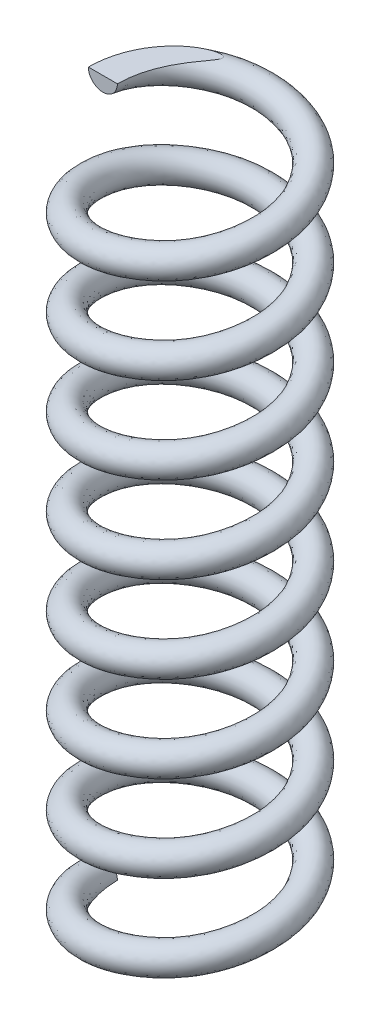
ISO-10303-21;
HEADER;
FILE_DESCRIPTION(('STEP AP214'),'2;1');
FILE_NAME('part.step','',(''),(''),'','','');
FILE_SCHEMA(('AUTOMOTIVE_DESIGN { 1 0 10303 214 1 1 1 1 }'));
ENDSEC;
DATA;
#1=APPLICATION_CONTEXT('core data for automotive mechanical design processes');
#2=APPLICATION_PROTOCOL_DEFINITION('international standard','automotive_design',2000,#1);
#3=PRODUCT_CONTEXT('',#1,'mechanical');
#4=PRODUCT('Part','Part','',(#3));
#5=PRODUCT_RELATED_PRODUCT_CATEGORY('part','',(#4));
#6=PRODUCT_DEFINITION_FORMATION('','',#4);
#7=PRODUCT_DEFINITION_CONTEXT('part definition',#1,'design');
#8=PRODUCT_DEFINITION('design','',#6,#7);
#9=PRODUCT_DEFINITION_SHAPE('','',#8);
#10=(LENGTH_UNIT() NAMED_UNIT(*) SI_UNIT(.MILLI.,.METRE.));
#11=(NAMED_UNIT(*) PLANE_ANGLE_UNIT() SI_UNIT($,.RADIAN.));
#12=(NAMED_UNIT(*) SI_UNIT($,.STERADIAN.) SOLID_ANGLE_UNIT());
#13=UNCERTAINTY_MEASURE_WITH_UNIT(LENGTH_MEASURE(1.E-05),#10,'distance_accuracy_value','');
#14=(GEOMETRIC_REPRESENTATION_CONTEXT(3) GLOBAL_UNCERTAINTY_ASSIGNED_CONTEXT((#13)) GLOBAL_UNIT_ASSIGNED_CONTEXT((#10,
#11,#12)) REPRESENTATION_CONTEXT('',''));
#15=CARTESIAN_POINT('',(0.,0.,0.));
#16=DIRECTION('',(0.,0.,1.));
#17=DIRECTION('',(1.,0.,0.));
#18=AXIS2_PLACEMENT_3D('',#15,#16,#17);
#19=CARTESIAN_POINT('',(-6.,32.5000000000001,0.));
#20=DIRECTION('',(0.,0.,1.));
#21=DIRECTION('',(1.,0.,0.));
#22=AXIS2_PLACEMENT_3D('',#19,#20,#21);
#23=PLANE('',#22);
#24=CARTESIAN_POINT('',(-6.,32.5000000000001,0.));
#25=DIRECTION('',(0.,0.,1.));
#26=DIRECTION('',(1.,0.,0.));
#27=AXIS2_PLACEMENT_3D('',#24,#25,#26);
#28=CIRCLE('',#27,1.);
#29=CARTESIAN_POINT('',(-5.,32.5000000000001,0.));
#30=VERTEX_POINT('',#29);
#31=CARTESIAN_POINT('',(-7.,32.5000000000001,0.));
#32=VERTEX_POINT('',#31);
#33=EDGE_CURVE('E62',#30,#32,#28,.T.);
#34=ORIENTED_EDGE('',*,*,#33,.F.);
#35=DIRECTION('',(-1.,0.,0.));
#36=VECTOR('',#35,1.);
#37=CARTESIAN_POINT('',(-6.,32.5000000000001,0.));
#38=LINE('',#37,#36);
#39=EDGE_CURVE('E70',#30,#32,#38,.T.);
#40=ORIENTED_EDGE('',*,*,#39,.T.);
#41=EDGE_LOOP('',(#34,#40));
#42=FACE_BOUND('',#41,.T.);
#43=ADVANCED_FACE('F35',(#42),#23,.F.);
#44=CARTESIAN_POINT('',(-6.,80.,6.70364417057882E-13));
#45=DIRECTION('',(1.1172740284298E-13,0.,1.));
#46=DIRECTION('',(1.,0.,-1.1172740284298E-13));
#47=AXIS2_PLACEMENT_3D('',#44,#45,#46);
#48=PLANE('',#47);
#49=DIRECTION('',(1.,0.,-1.1172740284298E-13));
#50=VECTOR('',#49,1.);
#51=CARTESIAN_POINT('',(-6.,80.,6.70364417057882E-13));
#52=LINE('',#51,#50);
#53=CARTESIAN_POINT('',(-7.,80.,6.714628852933E-13));
#54=VERTEX_POINT('',#53);
#55=CARTESIAN_POINT('',(-5.,80.,5.58637014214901E-13));
#56=VERTEX_POINT('',#55);
#57=EDGE_CURVE('E68',#54,#56,#52,.T.);
#58=ORIENTED_EDGE('',*,*,#57,.F.);
#59=CARTESIAN_POINT('',(-6.,80.,6.70364417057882E-13));
#60=DIRECTION('',(1.1172740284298E-13,0.,1.));
#61=DIRECTION('',(1.,0.,-1.1172740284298E-13));
#62=AXIS2_PLACEMENT_3D('',#59,#60,#61);
#63=CIRCLE('',#62,1.);
#64=EDGE_CURVE('E67',#54,#56,#63,.T.);
#65=ORIENTED_EDGE('',*,*,#64,.T.);
#66=EDGE_LOOP('',(#58,#65));
#67=FACE_BOUND('',#66,.T.);
#68=ADVANCED_FACE('F83',(#67),#48,.T.);
#69=CARTESIAN_POINT('',(-5.,32.5000000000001,0.));
#70=CARTESIAN_POINT('',(-5.,32.9947916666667,2.88675134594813));
#71=CARTESIAN_POINT('',(-2.5,33.4895833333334,4.33012701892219));
#72=CARTESIAN_POINT('',(0.,33.9843750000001,5.77350269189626));
#73=CARTESIAN_POINT('',(2.5,34.4791666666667,4.33012701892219));
#74=CARTESIAN_POINT('',(5.,34.9739583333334,2.88675134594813));
#75=CARTESIAN_POINT('',(5.,35.4687500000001,0.));
#76=CARTESIAN_POINT('',(5.,35.9635416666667,-2.88675134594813));
#77=CARTESIAN_POINT('',(2.5,36.4583333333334,-4.33012701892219));
#78=CARTESIAN_POINT('',(0.,36.953125,-5.77350269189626));
#79=CARTESIAN_POINT('',(-2.5,37.4479166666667,-4.33012701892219));
#80=CARTESIAN_POINT('',(-5.,37.9427083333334,-2.88675134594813));
#81=CARTESIAN_POINT('',(-5.,38.4375,0.));
#82=CARTESIAN_POINT('',(-5.,38.9322916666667,2.88675134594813));
#83=CARTESIAN_POINT('',(-2.5,39.4270833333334,4.33012701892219));
#84=CARTESIAN_POINT('',(0.,39.921875,5.77350269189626));
#85=CARTESIAN_POINT('',(2.5,40.4166666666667,4.33012701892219));
#86=CARTESIAN_POINT('',(5.,40.9114583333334,2.88675134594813));
#87=CARTESIAN_POINT('',(5.,41.40625,0.));
#88=CARTESIAN_POINT('',(5.,41.9010416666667,-2.88675134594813));
#89=CARTESIAN_POINT('',(2.5,42.3958333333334,-4.33012701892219));
#90=CARTESIAN_POINT('',(0.,42.890625,-5.77350269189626));
#91=CARTESIAN_POINT('',(-2.5,43.3854166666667,-4.33012701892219));
#92=CARTESIAN_POINT('',(-5.,43.8802083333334,-2.88675134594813));
#93=CARTESIAN_POINT('',(-5.,44.375,0.));
#94=CARTESIAN_POINT('',(-5.,44.8697916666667,2.88675134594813));
#95=CARTESIAN_POINT('',(-2.5,45.3645833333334,4.33012701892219));
#96=CARTESIAN_POINT('',(0.,45.859375,5.77350269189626));
#97=CARTESIAN_POINT('',(2.5,46.3541666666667,4.33012701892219));
#98=CARTESIAN_POINT('',(5.,46.8489583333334,2.88675134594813));
#99=CARTESIAN_POINT('',(5.,47.34375,0.));
#100=CARTESIAN_POINT('',(5.,47.8385416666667,-2.88675134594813));
#101=CARTESIAN_POINT('',(2.5,48.3333333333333,-4.33012701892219));
#102=CARTESIAN_POINT('',(0.,48.828125,-5.77350269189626));
#103=CARTESIAN_POINT('',(-2.5,49.3229166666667,-4.33012701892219));
#104=CARTESIAN_POINT('',(-5.,49.8177083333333,-2.88675134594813));
#105=CARTESIAN_POINT('',(-5.,50.3125,0.));
#106=CARTESIAN_POINT('',(-5.,50.8072916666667,2.88675134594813));
#107=CARTESIAN_POINT('',(-2.5,51.3020833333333,4.33012701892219));
#108=CARTESIAN_POINT('',(0.,51.796875,5.77350269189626));
#109=CARTESIAN_POINT('',(2.5,52.2916666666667,4.33012701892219));
#110=CARTESIAN_POINT('',(5.,52.7864583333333,2.88675134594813));
#111=CARTESIAN_POINT('',(5.,53.28125,0.));
#112=CARTESIAN_POINT('',(5.,53.7760416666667,-2.88675134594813));
#113=CARTESIAN_POINT('',(2.5,54.2708333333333,-4.33012701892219));
#114=CARTESIAN_POINT('',(0.,54.765625,-5.77350269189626));
#115=CARTESIAN_POINT('',(-2.5,55.2604166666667,-4.33012701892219));
#116=CARTESIAN_POINT('',(-5.,55.7552083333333,-2.88675134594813));
#117=CARTESIAN_POINT('',(-5.,56.25,0.));
#118=CARTESIAN_POINT('',(-5.,56.7447916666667,2.88675134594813));
#119=CARTESIAN_POINT('',(-2.5,57.2395833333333,4.33012701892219));
#120=CARTESIAN_POINT('',(0.,57.734375,5.77350269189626));
#121=CARTESIAN_POINT('',(2.5,58.2291666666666,4.33012701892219));
#122=CARTESIAN_POINT('',(5.,58.7239583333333,2.88675134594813));
#123=CARTESIAN_POINT('',(5.,59.21875,0.));
#124=CARTESIAN_POINT('',(5.,59.7135416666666,-2.88675134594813));
#125=CARTESIAN_POINT('',(2.5,60.2083333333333,-4.33012701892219));
#126=CARTESIAN_POINT('',(0.,60.703125,-5.77350269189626));
#127=CARTESIAN_POINT('',(-2.5,61.1979166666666,-4.33012701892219));
#128=CARTESIAN_POINT('',(-5.,61.6927083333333,-2.88675134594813));
#129=CARTESIAN_POINT('',(-5.,62.1875,0.));
#130=CARTESIAN_POINT('',(-5.,62.6822916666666,2.88675134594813));
#131=CARTESIAN_POINT('',(-2.5,63.1770833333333,4.33012701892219));
#132=CARTESIAN_POINT('',(0.,63.671875,5.77350269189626));
#133=CARTESIAN_POINT('',(2.5,64.1666666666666,4.33012701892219));
#134=CARTESIAN_POINT('',(5.,64.6614583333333,2.88675134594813));
#135=CARTESIAN_POINT('',(5.,65.1562499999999,0.));
#136=CARTESIAN_POINT('',(5.,65.6510416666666,-2.88675134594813));
#137=CARTESIAN_POINT('',(2.5,66.1458333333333,-4.33012701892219));
#138=CARTESIAN_POINT('',(0.,66.640625,-5.77350269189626));
#139=CARTESIAN_POINT('',(-2.5,67.1354166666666,-4.33012701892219));
#140=CARTESIAN_POINT('',(-5.,67.6302083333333,-2.88675134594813));
#141=CARTESIAN_POINT('',(-5.,68.1249999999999,0.));
#142=CARTESIAN_POINT('',(-5.,68.6197916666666,2.88675134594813));
#143=CARTESIAN_POINT('',(-2.5,69.1145833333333,4.33012701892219));
#144=CARTESIAN_POINT('',(0.,69.6093749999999,5.77350269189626));
#145=CARTESIAN_POINT('',(2.5,70.1041666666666,4.33012701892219));
#146=CARTESIAN_POINT('',(5.,70.5989583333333,2.88675134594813));
#147=CARTESIAN_POINT('',(5.,71.0937499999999,0.));
#148=CARTESIAN_POINT('',(5.,71.5885416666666,-2.88675134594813));
#149=CARTESIAN_POINT('',(2.5,72.0833333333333,-4.33012701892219));
#150=CARTESIAN_POINT('',(0.,72.5781249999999,-5.77350269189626));
#151=CARTESIAN_POINT('',(-2.5,73.0729166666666,-4.33012701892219));
#152=CARTESIAN_POINT('',(-5.,73.5677083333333,-2.88675134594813));
#153=CARTESIAN_POINT('',(-5.,74.0624999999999,0.));
#154=CARTESIAN_POINT('',(-5.,74.5572916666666,2.88675134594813));
#155=CARTESIAN_POINT('',(-2.5,75.0520833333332,4.33012701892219));
#156=CARTESIAN_POINT('',(0.,75.5468749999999,5.77350269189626));
#157=CARTESIAN_POINT('',(2.5,76.0416666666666,4.33012701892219));
#158=CARTESIAN_POINT('',(5.,76.5364583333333,2.88675134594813));
#159=CARTESIAN_POINT('',(5.,77.0312499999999,0.));
#160=CARTESIAN_POINT('',(5.,77.5260416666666,-2.88675134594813));
#161=CARTESIAN_POINT('',(2.5,78.0208333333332,-4.33012701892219));
#162=CARTESIAN_POINT('',(0.,78.5156249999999,-5.77350269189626));
#163=CARTESIAN_POINT('',(-2.5,79.0104166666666,-4.33012701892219));
#164=CARTESIAN_POINT('',(-5.,79.5052083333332,-2.88675134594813));
#165=CARTESIAN_POINT('',(-5.,79.9999999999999,0.));
#166=CARTESIAN_POINT('',(-5.,80.4947916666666,2.88675134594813));
#167=CARTESIAN_POINT('',(-2.5,80.9895833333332,4.33012701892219));
#168=CARTESIAN_POINT('',(0.,81.4843749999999,5.77350269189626));
#169=CARTESIAN_POINT('',(2.5,81.9791666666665,4.33012701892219));
#170=CARTESIAN_POINT('',(5.,82.4739583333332,2.88675134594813));
#171=CARTESIAN_POINT('',(5.,82.9687499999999,0.));
#172=CARTESIAN_POINT('',(5.,83.4635416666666,-2.88675134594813));
#173=CARTESIAN_POINT('',(2.5,83.9583333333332,-4.33012701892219));
#174=CARTESIAN_POINT('',(0.,84.4531249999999,-5.77350269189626));
#175=CARTESIAN_POINT('',(-2.5,84.9479166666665,-4.33012701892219));
#176=CARTESIAN_POINT('',(-5.,85.4427083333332,-2.88675134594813));
#177=CARTESIAN_POINT('',(-5.,85.9374999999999,0.));
#178=CARTESIAN_POINT('',(-5.,34.5000000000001,0.));
#179=CARTESIAN_POINT('',(-5.,34.9947916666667,2.88675134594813));
#180=CARTESIAN_POINT('',(-2.5,35.4895833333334,4.33012701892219));
#181=CARTESIAN_POINT('',(0.,35.9843750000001,5.77350269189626));
#182=CARTESIAN_POINT('',(2.5,36.4791666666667,4.33012701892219));
#183=CARTESIAN_POINT('',(5.,36.9739583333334,2.88675134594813));
#184=CARTESIAN_POINT('',(5.,37.4687500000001,0.));
#185=CARTESIAN_POINT('',(5.,37.9635416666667,-2.88675134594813));
#186=CARTESIAN_POINT('',(2.5,38.4583333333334,-4.33012701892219));
#187=CARTESIAN_POINT('',(0.,38.953125,-5.77350269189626));
#188=CARTESIAN_POINT('',(-2.5,39.4479166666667,-4.33012701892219));
#189=CARTESIAN_POINT('',(-5.,39.9427083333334,-2.88675134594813));
#190=CARTESIAN_POINT('',(-5.,40.4375,0.));
#191=CARTESIAN_POINT('',(-5.,40.9322916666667,2.88675134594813));
#192=CARTESIAN_POINT('',(-2.5,41.4270833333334,4.33012701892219));
#193=CARTESIAN_POINT('',(0.,41.921875,5.77350269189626));
#194=CARTESIAN_POINT('',(2.5,42.4166666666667,4.33012701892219));
#195=CARTESIAN_POINT('',(5.,42.9114583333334,2.88675134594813));
#196=CARTESIAN_POINT('',(5.,43.40625,0.));
#197=CARTESIAN_POINT('',(5.,43.9010416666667,-2.88675134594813));
#198=CARTESIAN_POINT('',(2.5,44.3958333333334,-4.33012701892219));
#199=CARTESIAN_POINT('',(0.,44.890625,-5.77350269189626));
#200=CARTESIAN_POINT('',(-2.5,45.3854166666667,-4.33012701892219));
#201=CARTESIAN_POINT('',(-5.,45.8802083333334,-2.88675134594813));
#202=CARTESIAN_POINT('',(-5.,46.375,0.));
#203=CARTESIAN_POINT('',(-5.,46.8697916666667,2.88675134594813));
#204=CARTESIAN_POINT('',(-2.5,47.3645833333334,4.33012701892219));
#205=CARTESIAN_POINT('',(0.,47.859375,5.77350269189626));
#206=CARTESIAN_POINT('',(2.5,48.3541666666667,4.33012701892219));
#207=CARTESIAN_POINT('',(5.,48.8489583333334,2.88675134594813));
#208=CARTESIAN_POINT('',(5.,49.34375,0.));
#209=CARTESIAN_POINT('',(5.,49.8385416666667,-2.88675134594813));
#210=CARTESIAN_POINT('',(2.5,50.3333333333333,-4.33012701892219));
#211=CARTESIAN_POINT('',(0.,50.828125,-5.77350269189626));
#212=CARTESIAN_POINT('',(-2.5,51.3229166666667,-4.33012701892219));
#213=CARTESIAN_POINT('',(-5.,51.8177083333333,-2.88675134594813));
#214=CARTESIAN_POINT('',(-5.,52.3125,0.));
#215=CARTESIAN_POINT('',(-5.,52.8072916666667,2.88675134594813));
#216=CARTESIAN_POINT('',(-2.5,53.3020833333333,4.33012701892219));
#217=CARTESIAN_POINT('',(0.,53.796875,5.77350269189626));
#218=CARTESIAN_POINT('',(2.5,54.2916666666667,4.33012701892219));
#219=CARTESIAN_POINT('',(5.,54.7864583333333,2.88675134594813));
#220=CARTESIAN_POINT('',(5.,55.28125,0.));
#221=CARTESIAN_POINT('',(5.,55.7760416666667,-2.88675134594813));
#222=CARTESIAN_POINT('',(2.5,56.2708333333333,-4.33012701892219));
#223=CARTESIAN_POINT('',(0.,56.765625,-5.77350269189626));
#224=CARTESIAN_POINT('',(-2.5,57.2604166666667,-4.33012701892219));
#225=CARTESIAN_POINT('',(-5.,57.7552083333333,-2.88675134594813));
#226=CARTESIAN_POINT('',(-5.,58.25,0.));
#227=CARTESIAN_POINT('',(-5.,58.7447916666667,2.88675134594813));
#228=CARTESIAN_POINT('',(-2.5,59.2395833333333,4.33012701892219));
#229=CARTESIAN_POINT('',(0.,59.734375,5.77350269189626));
#230=CARTESIAN_POINT('',(2.5,60.2291666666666,4.33012701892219));
#231=CARTESIAN_POINT('',(5.,60.7239583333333,2.88675134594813));
#232=CARTESIAN_POINT('',(5.,61.21875,0.));
#233=CARTESIAN_POINT('',(5.,61.7135416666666,-2.88675134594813));
#234=CARTESIAN_POINT('',(2.5,62.2083333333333,-4.33012701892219));
#235=CARTESIAN_POINT('',(0.,62.703125,-5.77350269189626));
#236=CARTESIAN_POINT('',(-2.5,63.1979166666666,-4.33012701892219));
#237=CARTESIAN_POINT('',(-5.,63.6927083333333,-2.88675134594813));
#238=CARTESIAN_POINT('',(-5.,64.1875,0.));
#239=CARTESIAN_POINT('',(-5.,64.6822916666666,2.88675134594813));
#240=CARTESIAN_POINT('',(-2.5,65.1770833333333,4.33012701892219));
#241=CARTESIAN_POINT('',(0.,65.671875,5.77350269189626));
#242=CARTESIAN_POINT('',(2.5,66.1666666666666,4.33012701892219));
#243=CARTESIAN_POINT('',(5.,66.6614583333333,2.88675134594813));
#244=CARTESIAN_POINT('',(5.,67.1562499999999,0.));
#245=CARTESIAN_POINT('',(5.,67.6510416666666,-2.88675134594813));
#246=CARTESIAN_POINT('',(2.5,68.1458333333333,-4.33012701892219));
#247=CARTESIAN_POINT('',(0.,68.640625,-5.77350269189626));
#248=CARTESIAN_POINT('',(-2.5,69.1354166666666,-4.33012701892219));
#249=CARTESIAN_POINT('',(-5.,69.6302083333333,-2.88675134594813));
#250=CARTESIAN_POINT('',(-5.,70.1249999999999,0.));
#251=CARTESIAN_POINT('',(-5.,70.6197916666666,2.88675134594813));
#252=CARTESIAN_POINT('',(-2.5,71.1145833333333,4.33012701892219));
#253=CARTESIAN_POINT('',(0.,71.6093749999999,5.77350269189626));
#254=CARTESIAN_POINT('',(2.5,72.1041666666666,4.33012701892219));
#255=CARTESIAN_POINT('',(5.,72.5989583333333,2.88675134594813));
#256=CARTESIAN_POINT('',(5.,73.0937499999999,0.));
#257=CARTESIAN_POINT('',(5.,73.5885416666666,-2.88675134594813));
#258=CARTESIAN_POINT('',(2.5,74.0833333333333,-4.33012701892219));
#259=CARTESIAN_POINT('',(0.,74.5781249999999,-5.77350269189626));
#260=CARTESIAN_POINT('',(-2.5,75.0729166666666,-4.33012701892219));
#261=CARTESIAN_POINT('',(-5.,75.5677083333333,-2.88675134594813));
#262=CARTESIAN_POINT('',(-5.,76.0624999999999,0.));
#263=CARTESIAN_POINT('',(-5.,76.5572916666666,2.88675134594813));
#264=CARTESIAN_POINT('',(-2.5,77.0520833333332,4.33012701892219));
#265=CARTESIAN_POINT('',(0.,77.5468749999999,5.77350269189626));
#266=CARTESIAN_POINT('',(2.5,78.0416666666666,4.33012701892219));
#267=CARTESIAN_POINT('',(5.,78.5364583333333,2.88675134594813));
#268=CARTESIAN_POINT('',(5.,79.0312499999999,0.));
#269=CARTESIAN_POINT('',(5.,79.5260416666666,-2.88675134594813));
#270=CARTESIAN_POINT('',(2.5,80.0208333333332,-4.33012701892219));
#271=CARTESIAN_POINT('',(0.,80.5156249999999,-5.77350269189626));
#272=CARTESIAN_POINT('',(-2.5,81.0104166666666,-4.33012701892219));
#273=CARTESIAN_POINT('',(-5.,81.5052083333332,-2.88675134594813));
#274=CARTESIAN_POINT('',(-5.,81.9999999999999,0.));
#275=CARTESIAN_POINT('',(-5.,82.4947916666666,2.88675134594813));
#276=CARTESIAN_POINT('',(-2.5,82.9895833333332,4.33012701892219));
#277=CARTESIAN_POINT('',(0.,83.4843749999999,5.77350269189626));
#278=CARTESIAN_POINT('',(2.5,83.9791666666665,4.33012701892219));
#279=CARTESIAN_POINT('',(5.,84.4739583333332,2.88675134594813));
#280=CARTESIAN_POINT('',(5.,84.9687499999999,0.));
#281=CARTESIAN_POINT('',(5.,85.4635416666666,-2.88675134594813));
#282=CARTESIAN_POINT('',(2.5,85.9583333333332,-4.33012701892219));
#283=CARTESIAN_POINT('',(0.,86.4531249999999,-5.77350269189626));
#284=CARTESIAN_POINT('',(-2.5,86.9479166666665,-4.33012701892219));
#285=CARTESIAN_POINT('',(-5.,87.4427083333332,-2.88675134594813));
#286=CARTESIAN_POINT('',(-5.,87.9374999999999,0.));
#287=CARTESIAN_POINT('',(-7.,34.5000000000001,0.));
#288=CARTESIAN_POINT('',(-7.,34.9947916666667,4.04145188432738));
#289=CARTESIAN_POINT('',(-3.5,35.4895833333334,6.06217782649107));
#290=CARTESIAN_POINT('',(0.,35.9843750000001,8.08290376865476));
#291=CARTESIAN_POINT('',(3.5,36.4791666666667,6.06217782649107));
#292=CARTESIAN_POINT('',(7.,36.9739583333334,4.04145188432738));
#293=CARTESIAN_POINT('',(7.,37.4687500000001,0.));
#294=CARTESIAN_POINT('',(7.,37.9635416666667,-4.04145188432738));
#295=CARTESIAN_POINT('',(3.5,38.4583333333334,-6.06217782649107));
#296=CARTESIAN_POINT('',(0.,38.953125,-8.08290376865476));
#297=CARTESIAN_POINT('',(-3.5,39.4479166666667,-6.06217782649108));
#298=CARTESIAN_POINT('',(-7.,39.9427083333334,-4.04145188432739));
#299=CARTESIAN_POINT('',(-7.,40.4375,0.));
#300=CARTESIAN_POINT('',(-7.,40.9322916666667,4.04145188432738));
#301=CARTESIAN_POINT('',(-3.5,41.4270833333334,6.06217782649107));
#302=CARTESIAN_POINT('',(0.,41.921875,8.08290376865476));
#303=CARTESIAN_POINT('',(3.5,42.4166666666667,6.06217782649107));
#304=CARTESIAN_POINT('',(7.,42.9114583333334,4.04145188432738));
#305=CARTESIAN_POINT('',(7.,43.40625,0.));
#306=CARTESIAN_POINT('',(7.,43.9010416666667,-4.04145188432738));
#307=CARTESIAN_POINT('',(3.5,44.3958333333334,-6.06217782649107));
#308=CARTESIAN_POINT('',(0.,44.890625,-8.08290376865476));
#309=CARTESIAN_POINT('',(-3.5,45.3854166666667,-6.06217782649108));
#310=CARTESIAN_POINT('',(-7.,45.8802083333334,-4.04145188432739));
#311=CARTESIAN_POINT('',(-7.,46.375,0.));
#312=CARTESIAN_POINT('',(-7.,46.8697916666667,4.04145188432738));
#313=CARTESIAN_POINT('',(-3.5,47.3645833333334,6.06217782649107));
#314=CARTESIAN_POINT('',(0.,47.859375,8.08290376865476));
#315=CARTESIAN_POINT('',(3.5,48.3541666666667,6.06217782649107));
#316=CARTESIAN_POINT('',(7.,48.8489583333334,4.04145188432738));
#317=CARTESIAN_POINT('',(7.,49.34375,0.));
#318=CARTESIAN_POINT('',(7.,49.8385416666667,-4.04145188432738));
#319=CARTESIAN_POINT('',(3.5,50.3333333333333,-6.06217782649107));
#320=CARTESIAN_POINT('',(0.,50.828125,-8.08290376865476));
#321=CARTESIAN_POINT('',(-3.5,51.3229166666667,-6.06217782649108));
#322=CARTESIAN_POINT('',(-7.,51.8177083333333,-4.04145188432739));
#323=CARTESIAN_POINT('',(-7.,52.3125,0.));
#324=CARTESIAN_POINT('',(-7.,52.8072916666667,4.04145188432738));
#325=CARTESIAN_POINT('',(-3.5,53.3020833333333,6.06217782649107));
#326=CARTESIAN_POINT('',(0.,53.796875,8.08290376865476));
#327=CARTESIAN_POINT('',(3.5,54.2916666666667,6.06217782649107));
#328=CARTESIAN_POINT('',(7.,54.7864583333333,4.04145188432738));
#329=CARTESIAN_POINT('',(7.,55.28125,0.));
#330=CARTESIAN_POINT('',(7.,55.7760416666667,-4.04145188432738));
#331=CARTESIAN_POINT('',(3.5,56.2708333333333,-6.06217782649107));
#332=CARTESIAN_POINT('',(0.,56.765625,-8.08290376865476));
#333=CARTESIAN_POINT('',(-3.5,57.2604166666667,-6.06217782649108));
#334=CARTESIAN_POINT('',(-7.,57.7552083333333,-4.04145188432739));
#335=CARTESIAN_POINT('',(-7.,58.25,0.));
#336=CARTESIAN_POINT('',(-7.,58.7447916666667,4.04145188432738));
#337=CARTESIAN_POINT('',(-3.5,59.2395833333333,6.06217782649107));
#338=CARTESIAN_POINT('',(0.,59.734375,8.08290376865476));
#339=CARTESIAN_POINT('',(3.5,60.2291666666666,6.06217782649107));
#340=CARTESIAN_POINT('',(7.,60.7239583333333,4.04145188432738));
#341=CARTESIAN_POINT('',(7.,61.21875,0.));
#342=CARTESIAN_POINT('',(7.,61.7135416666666,-4.04145188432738));
#343=CARTESIAN_POINT('',(3.5,62.2083333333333,-6.06217782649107));
#344=CARTESIAN_POINT('',(0.,62.703125,-8.08290376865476));
#345=CARTESIAN_POINT('',(-3.5,63.1979166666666,-6.06217782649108));
#346=CARTESIAN_POINT('',(-7.,63.6927083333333,-4.04145188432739));
#347=CARTESIAN_POINT('',(-7.,64.1875,0.));
#348=CARTESIAN_POINT('',(-7.,64.6822916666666,4.04145188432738));
#349=CARTESIAN_POINT('',(-3.5,65.1770833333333,6.06217782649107));
#350=CARTESIAN_POINT('',(0.,65.671875,8.08290376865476));
#351=CARTESIAN_POINT('',(3.5,66.1666666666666,6.06217782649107));
#352=CARTESIAN_POINT('',(7.,66.6614583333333,4.04145188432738));
#353=CARTESIAN_POINT('',(7.,67.1562499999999,0.));
#354=CARTESIAN_POINT('',(7.,67.6510416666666,-4.04145188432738));
#355=CARTESIAN_POINT('',(3.5,68.1458333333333,-6.06217782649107));
#356=CARTESIAN_POINT('',(0.,68.640625,-8.08290376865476));
#357=CARTESIAN_POINT('',(-3.5,69.1354166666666,-6.06217782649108));
#358=CARTESIAN_POINT('',(-7.,69.6302083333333,-4.04145188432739));
#359=CARTESIAN_POINT('',(-7.,70.1249999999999,0.));
#360=CARTESIAN_POINT('',(-7.,70.6197916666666,4.04145188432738));
#361=CARTESIAN_POINT('',(-3.5,71.1145833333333,6.06217782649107));
#362=CARTESIAN_POINT('',(0.,71.6093749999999,8.08290376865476));
#363=CARTESIAN_POINT('',(3.5,72.1041666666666,6.06217782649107));
#364=CARTESIAN_POINT('',(7.,72.5989583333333,4.04145188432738));
#365=CARTESIAN_POINT('',(7.,73.0937499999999,0.));
#366=CARTESIAN_POINT('',(7.,73.5885416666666,-4.04145188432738));
#367=CARTESIAN_POINT('',(3.5,74.0833333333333,-6.06217782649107));
#368=CARTESIAN_POINT('',(0.,74.5781249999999,-8.08290376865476));
#369=CARTESIAN_POINT('',(-3.5,75.0729166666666,-6.06217782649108));
#370=CARTESIAN_POINT('',(-7.,75.5677083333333,-4.04145188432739));
#371=CARTESIAN_POINT('',(-7.,76.0624999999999,0.));
#372=CARTESIAN_POINT('',(-7.,76.5572916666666,4.04145188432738));
#373=CARTESIAN_POINT('',(-3.5,77.0520833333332,6.06217782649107));
#374=CARTESIAN_POINT('',(0.,77.5468749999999,8.08290376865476));
#375=CARTESIAN_POINT('',(3.5,78.0416666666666,6.06217782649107));
#376=CARTESIAN_POINT('',(7.,78.5364583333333,4.04145188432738));
#377=CARTESIAN_POINT('',(7.,79.0312499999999,0.));
#378=CARTESIAN_POINT('',(7.,79.5260416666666,-4.04145188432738));
#379=CARTESIAN_POINT('',(3.5,80.0208333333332,-6.06217782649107));
#380=CARTESIAN_POINT('',(0.,80.5156249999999,-8.08290376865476));
#381=CARTESIAN_POINT('',(-3.5,81.0104166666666,-6.06217782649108));
#382=CARTESIAN_POINT('',(-7.,81.5052083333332,-4.04145188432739));
#383=CARTESIAN_POINT('',(-7.,81.9999999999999,0.));
#384=CARTESIAN_POINT('',(-7.,82.4947916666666,4.04145188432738));
#385=CARTESIAN_POINT('',(-3.5,82.9895833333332,6.06217782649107));
#386=CARTESIAN_POINT('',(0.,83.4843749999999,8.08290376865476));
#387=CARTESIAN_POINT('',(3.5,83.9791666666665,6.06217782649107));
#388=CARTESIAN_POINT('',(7.,84.4739583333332,4.04145188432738));
#389=CARTESIAN_POINT('',(7.,84.9687499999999,0.));
#390=CARTESIAN_POINT('',(7.,85.4635416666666,-4.04145188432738));
#391=CARTESIAN_POINT('',(3.5,85.9583333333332,-6.06217782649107));
#392=CARTESIAN_POINT('',(0.,86.4531249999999,-8.08290376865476));
#393=CARTESIAN_POINT('',(-3.5,86.9479166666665,-6.06217782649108));
#394=CARTESIAN_POINT('',(-7.,87.4427083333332,-4.04145188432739));
#395=CARTESIAN_POINT('',(-7.,87.9374999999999,0.));
#396=CARTESIAN_POINT('',(-7.,32.5000000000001,0.));
#397=CARTESIAN_POINT('',(-7.,32.9947916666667,4.04145188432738));
#398=CARTESIAN_POINT('',(-3.5,33.4895833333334,6.06217782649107));
#399=CARTESIAN_POINT('',(0.,33.9843750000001,8.08290376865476));
#400=CARTESIAN_POINT('',(3.5,34.4791666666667,6.06217782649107));
#401=CARTESIAN_POINT('',(7.,34.9739583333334,4.04145188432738));
#402=CARTESIAN_POINT('',(7.,35.4687500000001,0.));
#403=CARTESIAN_POINT('',(7.,35.9635416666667,-4.04145188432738));
#404=CARTESIAN_POINT('',(3.5,36.4583333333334,-6.06217782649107));
#405=CARTESIAN_POINT('',(0.,36.953125,-8.08290376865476));
#406=CARTESIAN_POINT('',(-3.5,37.4479166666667,-6.06217782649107));
#407=CARTESIAN_POINT('',(-7.,37.9427083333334,-4.04145188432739));
#408=CARTESIAN_POINT('',(-7.,38.4375,0.));
#409=CARTESIAN_POINT('',(-7.,38.9322916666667,4.04145188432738));
#410=CARTESIAN_POINT('',(-3.5,39.4270833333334,6.06217782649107));
#411=CARTESIAN_POINT('',(0.,39.921875,8.08290376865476));
#412=CARTESIAN_POINT('',(3.5,40.4166666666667,6.06217782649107));
#413=CARTESIAN_POINT('',(7.,40.9114583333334,4.04145188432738));
#414=CARTESIAN_POINT('',(7.,41.40625,0.));
#415=CARTESIAN_POINT('',(7.,41.9010416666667,-4.04145188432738));
#416=CARTESIAN_POINT('',(3.5,42.3958333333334,-6.06217782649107));
#417=CARTESIAN_POINT('',(0.,42.890625,-8.08290376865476));
#418=CARTESIAN_POINT('',(-3.5,43.3854166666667,-6.06217782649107));
#419=CARTESIAN_POINT('',(-7.,43.8802083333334,-4.04145188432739));
#420=CARTESIAN_POINT('',(-7.,44.375,0.));
#421=CARTESIAN_POINT('',(-7.,44.8697916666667,4.04145188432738));
#422=CARTESIAN_POINT('',(-3.5,45.3645833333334,6.06217782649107));
#423=CARTESIAN_POINT('',(0.,45.859375,8.08290376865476));
#424=CARTESIAN_POINT('',(3.5,46.3541666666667,6.06217782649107));
#425=CARTESIAN_POINT('',(7.,46.8489583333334,4.04145188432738));
#426=CARTESIAN_POINT('',(7.,47.34375,0.));
#427=CARTESIAN_POINT('',(7.,47.8385416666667,-4.04145188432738));
#428=CARTESIAN_POINT('',(3.5,48.3333333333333,-6.06217782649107));
#429=CARTESIAN_POINT('',(0.,48.828125,-8.08290376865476));
#430=CARTESIAN_POINT('',(-3.5,49.3229166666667,-6.06217782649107));
#431=CARTESIAN_POINT('',(-7.,49.8177083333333,-4.04145188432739));
#432=CARTESIAN_POINT('',(-7.,50.3125,0.));
#433=CARTESIAN_POINT('',(-7.,50.8072916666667,4.04145188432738));
#434=CARTESIAN_POINT('',(-3.5,51.3020833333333,6.06217782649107));
#435=CARTESIAN_POINT('',(0.,51.796875,8.08290376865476));
#436=CARTESIAN_POINT('',(3.5,52.2916666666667,6.06217782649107));
#437=CARTESIAN_POINT('',(7.,52.7864583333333,4.04145188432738));
#438=CARTESIAN_POINT('',(7.,53.28125,0.));
#439=CARTESIAN_POINT('',(7.,53.7760416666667,-4.04145188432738));
#440=CARTESIAN_POINT('',(3.5,54.2708333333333,-6.06217782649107));
#441=CARTESIAN_POINT('',(0.,54.765625,-8.08290376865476));
#442=CARTESIAN_POINT('',(-3.5,55.2604166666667,-6.06217782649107));
#443=CARTESIAN_POINT('',(-7.,55.7552083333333,-4.04145188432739));
#444=CARTESIAN_POINT('',(-7.,56.25,0.));
#445=CARTESIAN_POINT('',(-7.,56.7447916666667,4.04145188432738));
#446=CARTESIAN_POINT('',(-3.5,57.2395833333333,6.06217782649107));
#447=CARTESIAN_POINT('',(0.,57.734375,8.08290376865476));
#448=CARTESIAN_POINT('',(3.5,58.2291666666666,6.06217782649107));
#449=CARTESIAN_POINT('',(7.,58.7239583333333,4.04145188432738));
#450=CARTESIAN_POINT('',(7.,59.21875,0.));
#451=CARTESIAN_POINT('',(7.,59.7135416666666,-4.04145188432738));
#452=CARTESIAN_POINT('',(3.5,60.2083333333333,-6.06217782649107));
#453=CARTESIAN_POINT('',(0.,60.703125,-8.08290376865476));
#454=CARTESIAN_POINT('',(-3.5,61.1979166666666,-6.06217782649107));
#455=CARTESIAN_POINT('',(-7.,61.6927083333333,-4.04145188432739));
#456=CARTESIAN_POINT('',(-7.,62.1875,0.));
#457=CARTESIAN_POINT('',(-7.,62.6822916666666,4.04145188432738));
#458=CARTESIAN_POINT('',(-3.5,63.1770833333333,6.06217782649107));
#459=CARTESIAN_POINT('',(0.,63.671875,8.08290376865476));
#460=CARTESIAN_POINT('',(3.5,64.1666666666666,6.06217782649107));
#461=CARTESIAN_POINT('',(7.,64.6614583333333,4.04145188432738));
#462=CARTESIAN_POINT('',(7.,65.1562499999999,0.));
#463=CARTESIAN_POINT('',(7.,65.6510416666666,-4.04145188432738));
#464=CARTESIAN_POINT('',(3.5,66.1458333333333,-6.06217782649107));
#465=CARTESIAN_POINT('',(0.,66.640625,-8.08290376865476));
#466=CARTESIAN_POINT('',(-3.5,67.1354166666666,-6.06217782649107));
#467=CARTESIAN_POINT('',(-7.,67.6302083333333,-4.04145188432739));
#468=CARTESIAN_POINT('',(-7.,68.1249999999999,0.));
#469=CARTESIAN_POINT('',(-7.,68.6197916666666,4.04145188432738));
#470=CARTESIAN_POINT('',(-3.5,69.1145833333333,6.06217782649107));
#471=CARTESIAN_POINT('',(0.,69.6093749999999,8.08290376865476));
#472=CARTESIAN_POINT('',(3.5,70.1041666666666,6.06217782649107));
#473=CARTESIAN_POINT('',(7.,70.5989583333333,4.04145188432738));
#474=CARTESIAN_POINT('',(7.,71.0937499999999,0.));
#475=CARTESIAN_POINT('',(7.,71.5885416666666,-4.04145188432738));
#476=CARTESIAN_POINT('',(3.5,72.0833333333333,-6.06217782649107));
#477=CARTESIAN_POINT('',(0.,72.5781249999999,-8.08290376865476));
#478=CARTESIAN_POINT('',(-3.5,73.0729166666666,-6.06217782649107));
#479=CARTESIAN_POINT('',(-7.,73.5677083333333,-4.04145188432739));
#480=CARTESIAN_POINT('',(-7.,74.0624999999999,0.));
#481=CARTESIAN_POINT('',(-7.,74.5572916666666,4.04145188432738));
#482=CARTESIAN_POINT('',(-3.5,75.0520833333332,6.06217782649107));
#483=CARTESIAN_POINT('',(0.,75.5468749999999,8.08290376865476));
#484=CARTESIAN_POINT('',(3.5,76.0416666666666,6.06217782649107));
#485=CARTESIAN_POINT('',(7.,76.5364583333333,4.04145188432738));
#486=CARTESIAN_POINT('',(7.,77.0312499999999,0.));
#487=CARTESIAN_POINT('',(7.,77.5260416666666,-4.04145188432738));
#488=CARTESIAN_POINT('',(3.5,78.0208333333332,-6.06217782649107));
#489=CARTESIAN_POINT('',(0.,78.5156249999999,-8.08290376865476));
#490=CARTESIAN_POINT('',(-3.5,79.0104166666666,-6.06217782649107));
#491=CARTESIAN_POINT('',(-7.,79.5052083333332,-4.04145188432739));
#492=CARTESIAN_POINT('',(-7.,79.9999999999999,0.));
#493=CARTESIAN_POINT('',(-7.,80.4947916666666,4.04145188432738));
#494=CARTESIAN_POINT('',(-3.5,80.9895833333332,6.06217782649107));
#495=CARTESIAN_POINT('',(0.,81.4843749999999,8.08290376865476));
#496=CARTESIAN_POINT('',(3.5,81.9791666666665,6.06217782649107));
#497=CARTESIAN_POINT('',(7.,82.4739583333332,4.04145188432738));
#498=CARTESIAN_POINT('',(7.,82.9687499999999,0.));
#499=CARTESIAN_POINT('',(7.,83.4635416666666,-4.04145188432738));
#500=CARTESIAN_POINT('',(3.5,83.9583333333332,-6.06217782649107));
#501=CARTESIAN_POINT('',(0.,84.4531249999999,-8.08290376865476));
#502=CARTESIAN_POINT('',(-3.5,84.9479166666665,-6.06217782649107));
#503=CARTESIAN_POINT('',(-7.,85.4427083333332,-4.04145188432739));
#504=CARTESIAN_POINT('',(-7.,85.9374999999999,0.));
#505=CARTESIAN_POINT('',(-7.,30.5000000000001,0.));
#506=CARTESIAN_POINT('',(-7.,30.9947916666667,4.04145188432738));
#507=CARTESIAN_POINT('',(-3.5,31.4895833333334,6.06217782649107));
#508=CARTESIAN_POINT('',(0.,31.9843750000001,8.08290376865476));
#509=CARTESIAN_POINT('',(3.5,32.4791666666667,6.06217782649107));
#510=CARTESIAN_POINT('',(7.,32.9739583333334,4.04145188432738));
#511=CARTESIAN_POINT('',(7.,33.4687500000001,0.));
#512=CARTESIAN_POINT('',(7.,33.9635416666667,-4.04145188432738));
#513=CARTESIAN_POINT('',(3.5,34.4583333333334,-6.06217782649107));
#514=CARTESIAN_POINT('',(0.,34.953125,-8.08290376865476));
#515=CARTESIAN_POINT('',(-3.5,35.4479166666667,-6.06217782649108));
#516=CARTESIAN_POINT('',(-7.,35.9427083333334,-4.04145188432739));
#517=CARTESIAN_POINT('',(-7.,36.4375,0.));
#518=CARTESIAN_POINT('',(-7.,36.9322916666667,4.04145188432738));
#519=CARTESIAN_POINT('',(-3.5,37.4270833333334,6.06217782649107));
#520=CARTESIAN_POINT('',(0.,37.921875,8.08290376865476));
#521=CARTESIAN_POINT('',(3.5,38.4166666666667,6.06217782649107));
#522=CARTESIAN_POINT('',(7.,38.9114583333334,4.04145188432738));
#523=CARTESIAN_POINT('',(7.,39.40625,0.));
#524=CARTESIAN_POINT('',(7.,39.9010416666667,-4.04145188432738));
#525=CARTESIAN_POINT('',(3.5,40.3958333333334,-6.06217782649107));
#526=CARTESIAN_POINT('',(0.,40.890625,-8.08290376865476));
#527=CARTESIAN_POINT('',(-3.5,41.3854166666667,-6.06217782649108));
#528=CARTESIAN_POINT('',(-7.,41.8802083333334,-4.04145188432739));
#529=CARTESIAN_POINT('',(-7.,42.375,0.));
#530=CARTESIAN_POINT('',(-7.,42.8697916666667,4.04145188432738));
#531=CARTESIAN_POINT('',(-3.5,43.3645833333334,6.06217782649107));
#532=CARTESIAN_POINT('',(0.,43.859375,8.08290376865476));
#533=CARTESIAN_POINT('',(3.5,44.3541666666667,6.06217782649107));
#534=CARTESIAN_POINT('',(7.,44.8489583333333,4.04145188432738));
#535=CARTESIAN_POINT('',(7.,45.34375,0.));
#536=CARTESIAN_POINT('',(7.,45.8385416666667,-4.04145188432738));
#537=CARTESIAN_POINT('',(3.5,46.3333333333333,-6.06217782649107));
#538=CARTESIAN_POINT('',(0.,46.828125,-8.08290376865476));
#539=CARTESIAN_POINT('',(-3.5,47.3229166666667,-6.06217782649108));
#540=CARTESIAN_POINT('',(-7.,47.8177083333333,-4.04145188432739));
#541=CARTESIAN_POINT('',(-7.,48.3125,0.));
#542=CARTESIAN_POINT('',(-7.,48.8072916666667,4.04145188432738));
#543=CARTESIAN_POINT('',(-3.5,49.3020833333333,6.06217782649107));
#544=CARTESIAN_POINT('',(0.,49.796875,8.08290376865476));
#545=CARTESIAN_POINT('',(3.5,50.2916666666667,6.06217782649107));
#546=CARTESIAN_POINT('',(7.,50.7864583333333,4.04145188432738));
#547=CARTESIAN_POINT('',(7.,51.28125,0.));
#548=CARTESIAN_POINT('',(7.,51.7760416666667,-4.04145188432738));
#549=CARTESIAN_POINT('',(3.5,52.2708333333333,-6.06217782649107));
#550=CARTESIAN_POINT('',(0.,52.765625,-8.08290376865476));
#551=CARTESIAN_POINT('',(-3.5,53.2604166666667,-6.06217782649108));
#552=CARTESIAN_POINT('',(-7.,53.7552083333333,-4.04145188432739));
#553=CARTESIAN_POINT('',(-7.,54.25,0.));
#554=CARTESIAN_POINT('',(-7.,54.7447916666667,4.04145188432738));
#555=CARTESIAN_POINT('',(-3.5,55.2395833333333,6.06217782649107));
#556=CARTESIAN_POINT('',(0.,55.734375,8.08290376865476));
#557=CARTESIAN_POINT('',(3.5,56.2291666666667,6.06217782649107));
#558=CARTESIAN_POINT('',(7.,56.7239583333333,4.04145188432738));
#559=CARTESIAN_POINT('',(7.,57.21875,0.));
#560=CARTESIAN_POINT('',(7.,57.7135416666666,-4.04145188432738));
#561=CARTESIAN_POINT('',(3.5,58.2083333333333,-6.06217782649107));
#562=CARTESIAN_POINT('',(0.,58.703125,-8.08290376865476));
#563=CARTESIAN_POINT('',(-3.5,59.1979166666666,-6.06217782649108));
#564=CARTESIAN_POINT('',(-7.,59.6927083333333,-4.04145188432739));
#565=CARTESIAN_POINT('',(-7.,60.1875,0.));
#566=CARTESIAN_POINT('',(-7.,60.6822916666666,4.04145188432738));
#567=CARTESIAN_POINT('',(-3.5,61.1770833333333,6.06217782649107));
#568=CARTESIAN_POINT('',(0.,61.671875,8.08290376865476));
#569=CARTESIAN_POINT('',(3.5,62.1666666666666,6.06217782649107));
#570=CARTESIAN_POINT('',(7.,62.6614583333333,4.04145188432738));
#571=CARTESIAN_POINT('',(7.,63.1562499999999,0.));
#572=CARTESIAN_POINT('',(7.,63.6510416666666,-4.04145188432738));
#573=CARTESIAN_POINT('',(3.5,64.1458333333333,-6.06217782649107));
#574=CARTESIAN_POINT('',(0.,64.640625,-8.08290376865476));
#575=CARTESIAN_POINT('',(-3.5,65.1354166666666,-6.06217782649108));
#576=CARTESIAN_POINT('',(-7.,65.6302083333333,-4.04145188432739));
#577=CARTESIAN_POINT('',(-7.,66.1249999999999,0.));
#578=CARTESIAN_POINT('',(-7.,66.6197916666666,4.04145188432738));
#579=CARTESIAN_POINT('',(-3.5,67.1145833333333,6.06217782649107));
#580=CARTESIAN_POINT('',(0.,67.609375,8.08290376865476));
#581=CARTESIAN_POINT('',(3.5,68.1041666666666,6.06217782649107));
#582=CARTESIAN_POINT('',(7.,68.5989583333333,4.04145188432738));
#583=CARTESIAN_POINT('',(7.,69.0937499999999,0.));
#584=CARTESIAN_POINT('',(7.,69.5885416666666,-4.04145188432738));
#585=CARTESIAN_POINT('',(3.5,70.0833333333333,-6.06217782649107));
#586=CARTESIAN_POINT('',(0.,70.5781249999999,-8.08290376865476));
#587=CARTESIAN_POINT('',(-3.5,71.0729166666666,-6.06217782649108));
#588=CARTESIAN_POINT('',(-7.,71.5677083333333,-4.04145188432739));
#589=CARTESIAN_POINT('',(-7.,72.0624999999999,0.));
#590=CARTESIAN_POINT('',(-7.,72.5572916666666,4.04145188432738));
#591=CARTESIAN_POINT('',(-3.5,73.0520833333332,6.06217782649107));
#592=CARTESIAN_POINT('',(0.,73.5468749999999,8.08290376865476));
#593=CARTESIAN_POINT('',(3.5,74.0416666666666,6.06217782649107));
#594=CARTESIAN_POINT('',(7.,74.5364583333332,4.04145188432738));
#595=CARTESIAN_POINT('',(7.,75.0312499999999,0.));
#596=CARTESIAN_POINT('',(7.,75.5260416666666,-4.04145188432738));
#597=CARTESIAN_POINT('',(3.5,76.0208333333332,-6.06217782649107));
#598=CARTESIAN_POINT('',(0.,76.5156249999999,-8.08290376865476));
#599=CARTESIAN_POINT('',(-3.5,77.0104166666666,-6.06217782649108));
#600=CARTESIAN_POINT('',(-7.,77.5052083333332,-4.04145188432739));
#601=CARTESIAN_POINT('',(-7.,77.9999999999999,0.));
#602=CARTESIAN_POINT('',(-7.,78.4947916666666,4.04145188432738));
#603=CARTESIAN_POINT('',(-3.5,78.9895833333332,6.06217782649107));
#604=CARTESIAN_POINT('',(0.,79.4843749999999,8.08290376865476));
#605=CARTESIAN_POINT('',(3.5,79.9791666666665,6.06217782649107));
#606=CARTESIAN_POINT('',(7.,80.4739583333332,4.04145188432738));
#607=CARTESIAN_POINT('',(7.,80.9687499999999,0.));
#608=CARTESIAN_POINT('',(7.,81.4635416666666,-4.04145188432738));
#609=CARTESIAN_POINT('',(3.5,81.9583333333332,-6.06217782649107));
#610=CARTESIAN_POINT('',(0.,82.4531249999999,-8.08290376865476));
#611=CARTESIAN_POINT('',(-3.5,82.9479166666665,-6.06217782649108));
#612=CARTESIAN_POINT('',(-7.,83.4427083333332,-4.04145188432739));
#613=CARTESIAN_POINT('',(-7.,83.9374999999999,0.));
#614=CARTESIAN_POINT('',(-5.,30.5000000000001,0.));
#615=CARTESIAN_POINT('',(-5.,30.9947916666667,2.88675134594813));
#616=CARTESIAN_POINT('',(-2.5,31.4895833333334,4.33012701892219));
#617=CARTESIAN_POINT('',(0.,31.9843750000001,5.77350269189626));
#618=CARTESIAN_POINT('',(2.5,32.4791666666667,4.33012701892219));
#619=CARTESIAN_POINT('',(5.,32.9739583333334,2.88675134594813));
#620=CARTESIAN_POINT('',(5.,33.4687500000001,0.));
#621=CARTESIAN_POINT('',(5.,33.9635416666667,-2.88675134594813));
#622=CARTESIAN_POINT('',(2.5,34.4583333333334,-4.33012701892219));
#623=CARTESIAN_POINT('',(0.,34.953125,-5.77350269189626));
#624=CARTESIAN_POINT('',(-2.5,35.4479166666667,-4.33012701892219));
#625=CARTESIAN_POINT('',(-5.,35.9427083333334,-2.88675134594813));
#626=CARTESIAN_POINT('',(-5.,36.4375,0.));
#627=CARTESIAN_POINT('',(-5.,36.9322916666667,2.88675134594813));
#628=CARTESIAN_POINT('',(-2.5,37.4270833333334,4.33012701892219));
#629=CARTESIAN_POINT('',(0.,37.921875,5.77350269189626));
#630=CARTESIAN_POINT('',(2.5,38.4166666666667,4.33012701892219));
#631=CARTESIAN_POINT('',(5.,38.9114583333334,2.88675134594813));
#632=CARTESIAN_POINT('',(5.,39.40625,0.));
#633=CARTESIAN_POINT('',(5.,39.9010416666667,-2.88675134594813));
#634=CARTESIAN_POINT('',(2.5,40.3958333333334,-4.33012701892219));
#635=CARTESIAN_POINT('',(0.,40.890625,-5.77350269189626));
#636=CARTESIAN_POINT('',(-2.5,41.3854166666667,-4.33012701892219));
#637=CARTESIAN_POINT('',(-5.,41.8802083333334,-2.88675134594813));
#638=CARTESIAN_POINT('',(-5.,42.375,0.));
#639=CARTESIAN_POINT('',(-5.,42.8697916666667,2.88675134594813));
#640=CARTESIAN_POINT('',(-2.5,43.3645833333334,4.33012701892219));
#641=CARTESIAN_POINT('',(0.,43.859375,5.77350269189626));
#642=CARTESIAN_POINT('',(2.5,44.3541666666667,4.33012701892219));
#643=CARTESIAN_POINT('',(5.,44.8489583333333,2.88675134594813));
#644=CARTESIAN_POINT('',(5.,45.34375,0.));
#645=CARTESIAN_POINT('',(5.,45.8385416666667,-2.88675134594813));
#646=CARTESIAN_POINT('',(2.5,46.3333333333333,-4.33012701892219));
#647=CARTESIAN_POINT('',(0.,46.828125,-5.77350269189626));
#648=CARTESIAN_POINT('',(-2.5,47.3229166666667,-4.33012701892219));
#649=CARTESIAN_POINT('',(-5.,47.8177083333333,-2.88675134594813));
#650=CARTESIAN_POINT('',(-5.,48.3125,0.));
#651=CARTESIAN_POINT('',(-5.,48.8072916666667,2.88675134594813));
#652=CARTESIAN_POINT('',(-2.5,49.3020833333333,4.33012701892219));
#653=CARTESIAN_POINT('',(0.,49.796875,5.77350269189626));
#654=CARTESIAN_POINT('',(2.5,50.2916666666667,4.33012701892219));
#655=CARTESIAN_POINT('',(5.,50.7864583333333,2.88675134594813));
#656=CARTESIAN_POINT('',(5.,51.28125,0.));
#657=CARTESIAN_POINT('',(5.,51.7760416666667,-2.88675134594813));
#658=CARTESIAN_POINT('',(2.5,52.2708333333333,-4.33012701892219));
#659=CARTESIAN_POINT('',(0.,52.765625,-5.77350269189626));
#660=CARTESIAN_POINT('',(-2.5,53.2604166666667,-4.33012701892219));
#661=CARTESIAN_POINT('',(-5.,53.7552083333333,-2.88675134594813));
#662=CARTESIAN_POINT('',(-5.,54.25,0.));
#663=CARTESIAN_POINT('',(-5.,54.7447916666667,2.88675134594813));
#664=CARTESIAN_POINT('',(-2.5,55.2395833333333,4.33012701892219));
#665=CARTESIAN_POINT('',(0.,55.734375,5.77350269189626));
#666=CARTESIAN_POINT('',(2.5,56.2291666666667,4.33012701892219));
#667=CARTESIAN_POINT('',(5.,56.7239583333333,2.88675134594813));
#668=CARTESIAN_POINT('',(5.,57.21875,0.));
#669=CARTESIAN_POINT('',(5.,57.7135416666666,-2.88675134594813));
#670=CARTESIAN_POINT('',(2.5,58.2083333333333,-4.33012701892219));
#671=CARTESIAN_POINT('',(0.,58.703125,-5.77350269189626));
#672=CARTESIAN_POINT('',(-2.5,59.1979166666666,-4.33012701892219));
#673=CARTESIAN_POINT('',(-5.,59.6927083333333,-2.88675134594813));
#674=CARTESIAN_POINT('',(-5.,60.1875,0.));
#675=CARTESIAN_POINT('',(-5.,60.6822916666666,2.88675134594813));
#676=CARTESIAN_POINT('',(-2.5,61.1770833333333,4.33012701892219));
#677=CARTESIAN_POINT('',(0.,61.671875,5.77350269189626));
#678=CARTESIAN_POINT('',(2.5,62.1666666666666,4.33012701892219));
#679=CARTESIAN_POINT('',(5.,62.6614583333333,2.88675134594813));
#680=CARTESIAN_POINT('',(5.,63.1562499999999,0.));
#681=CARTESIAN_POINT('',(5.,63.6510416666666,-2.88675134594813));
#682=CARTESIAN_POINT('',(2.5,64.1458333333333,-4.33012701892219));
#683=CARTESIAN_POINT('',(0.,64.640625,-5.77350269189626));
#684=CARTESIAN_POINT('',(-2.5,65.1354166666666,-4.33012701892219));
#685=CARTESIAN_POINT('',(-5.,65.6302083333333,-2.88675134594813));
#686=CARTESIAN_POINT('',(-5.,66.1249999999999,0.));
#687=CARTESIAN_POINT('',(-5.,66.6197916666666,2.88675134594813));
#688=CARTESIAN_POINT('',(-2.5,67.1145833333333,4.33012701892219));
#689=CARTESIAN_POINT('',(0.,67.609375,5.77350269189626));
#690=CARTESIAN_POINT('',(2.5,68.1041666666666,4.33012701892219));
#691=CARTESIAN_POINT('',(5.,68.5989583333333,2.88675134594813));
#692=CARTESIAN_POINT('',(5.,69.0937499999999,0.));
#693=CARTESIAN_POINT('',(5.,69.5885416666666,-2.88675134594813));
#694=CARTESIAN_POINT('',(2.5,70.0833333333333,-4.33012701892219));
#695=CARTESIAN_POINT('',(0.,70.5781249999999,-5.77350269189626));
#696=CARTESIAN_POINT('',(-2.5,71.0729166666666,-4.33012701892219));
#697=CARTESIAN_POINT('',(-5.,71.5677083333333,-2.88675134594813));
#698=CARTESIAN_POINT('',(-5.,72.0624999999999,0.));
#699=CARTESIAN_POINT('',(-5.,72.5572916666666,2.88675134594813));
#700=CARTESIAN_POINT('',(-2.5,73.0520833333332,4.33012701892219));
#701=CARTESIAN_POINT('',(0.,73.5468749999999,5.77350269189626));
#702=CARTESIAN_POINT('',(2.5,74.0416666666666,4.33012701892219));
#703=CARTESIAN_POINT('',(5.,74.5364583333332,2.88675134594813));
#704=CARTESIAN_POINT('',(5.,75.0312499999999,0.));
#705=CARTESIAN_POINT('',(5.,75.5260416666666,-2.88675134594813));
#706=CARTESIAN_POINT('',(2.5,76.0208333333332,-4.33012701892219));
#707=CARTESIAN_POINT('',(0.,76.5156249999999,-5.77350269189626));
#708=CARTESIAN_POINT('',(-2.5,77.0104166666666,-4.33012701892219));
#709=CARTESIAN_POINT('',(-5.,77.5052083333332,-2.88675134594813));
#710=CARTESIAN_POINT('',(-5.,77.9999999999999,0.));
#711=CARTESIAN_POINT('',(-5.,78.4947916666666,2.88675134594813));
#712=CARTESIAN_POINT('',(-2.5,78.9895833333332,4.33012701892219));
#713=CARTESIAN_POINT('',(0.,79.4843749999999,5.77350269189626));
#714=CARTESIAN_POINT('',(2.5,79.9791666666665,4.33012701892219));
#715=CARTESIAN_POINT('',(5.,80.4739583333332,2.88675134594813));
#716=CARTESIAN_POINT('',(5.,80.9687499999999,0.));
#717=CARTESIAN_POINT('',(5.,81.4635416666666,-2.88675134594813));
#718=CARTESIAN_POINT('',(2.5,81.9583333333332,-4.33012701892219));
#719=CARTESIAN_POINT('',(0.,82.4531249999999,-5.77350269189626));
#720=CARTESIAN_POINT('',(-2.5,82.9479166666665,-4.33012701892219));
#721=CARTESIAN_POINT('',(-5.,83.4427083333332,-2.88675134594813));
#722=CARTESIAN_POINT('',(-5.,83.9374999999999,0.));
#723=CARTESIAN_POINT('',(-5.,32.5000000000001,0.));
#724=CARTESIAN_POINT('',(-5.,32.9947916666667,2.88675134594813));
#725=CARTESIAN_POINT('',(-2.5,33.4895833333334,4.33012701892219));
#726=CARTESIAN_POINT('',(0.,33.9843750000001,5.77350269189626));
#727=CARTESIAN_POINT('',(2.5,34.4791666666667,4.33012701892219));
#728=CARTESIAN_POINT('',(5.,34.9739583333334,2.88675134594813));
#729=CARTESIAN_POINT('',(5.,35.4687500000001,0.));
#730=CARTESIAN_POINT('',(5.,35.9635416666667,-2.88675134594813));
#731=CARTESIAN_POINT('',(2.5,36.4583333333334,-4.33012701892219));
#732=CARTESIAN_POINT('',(0.,36.953125,-5.77350269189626));
#733=CARTESIAN_POINT('',(-2.5,37.4479166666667,-4.33012701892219));
#734=CARTESIAN_POINT('',(-5.,37.9427083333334,-2.88675134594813));
#735=CARTESIAN_POINT('',(-5.,38.4375,0.));
#736=CARTESIAN_POINT('',(-5.,38.9322916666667,2.88675134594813));
#737=CARTESIAN_POINT('',(-2.5,39.4270833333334,4.33012701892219));
#738=CARTESIAN_POINT('',(0.,39.921875,5.77350269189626));
#739=CARTESIAN_POINT('',(2.5,40.4166666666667,4.33012701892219));
#740=CARTESIAN_POINT('',(5.,40.9114583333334,2.88675134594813));
#741=CARTESIAN_POINT('',(5.,41.40625,0.));
#742=CARTESIAN_POINT('',(5.,41.9010416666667,-2.88675134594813));
#743=CARTESIAN_POINT('',(2.5,42.3958333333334,-4.33012701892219));
#744=CARTESIAN_POINT('',(0.,42.890625,-5.77350269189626));
#745=CARTESIAN_POINT('',(-2.5,43.3854166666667,-4.33012701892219));
#746=CARTESIAN_POINT('',(-5.,43.8802083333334,-2.88675134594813));
#747=CARTESIAN_POINT('',(-5.,44.375,0.));
#748=CARTESIAN_POINT('',(-5.,44.8697916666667,2.88675134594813));
#749=CARTESIAN_POINT('',(-2.5,45.3645833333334,4.33012701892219));
#750=CARTESIAN_POINT('',(0.,45.859375,5.77350269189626));
#751=CARTESIAN_POINT('',(2.5,46.3541666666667,4.33012701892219));
#752=CARTESIAN_POINT('',(5.,46.8489583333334,2.88675134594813));
#753=CARTESIAN_POINT('',(5.,47.34375,0.));
#754=CARTESIAN_POINT('',(5.,47.8385416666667,-2.88675134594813));
#755=CARTESIAN_POINT('',(2.5,48.3333333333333,-4.33012701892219));
#756=CARTESIAN_POINT('',(0.,48.828125,-5.77350269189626));
#757=CARTESIAN_POINT('',(-2.5,49.3229166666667,-4.33012701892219));
#758=CARTESIAN_POINT('',(-5.,49.8177083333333,-2.88675134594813));
#759=CARTESIAN_POINT('',(-5.,50.3125,0.));
#760=CARTESIAN_POINT('',(-5.,50.8072916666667,2.88675134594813));
#761=CARTESIAN_POINT('',(-2.5,51.3020833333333,4.33012701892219));
#762=CARTESIAN_POINT('',(0.,51.796875,5.77350269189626));
#763=CARTESIAN_POINT('',(2.5,52.2916666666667,4.33012701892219));
#764=CARTESIAN_POINT('',(5.,52.7864583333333,2.88675134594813));
#765=CARTESIAN_POINT('',(5.,53.28125,0.));
#766=CARTESIAN_POINT('',(5.,53.7760416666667,-2.88675134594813));
#767=CARTESIAN_POINT('',(2.5,54.2708333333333,-4.33012701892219));
#768=CARTESIAN_POINT('',(0.,54.765625,-5.77350269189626));
#769=CARTESIAN_POINT('',(-2.5,55.2604166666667,-4.33012701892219));
#770=CARTESIAN_POINT('',(-5.,55.7552083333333,-2.88675134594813));
#771=CARTESIAN_POINT('',(-5.,56.25,0.));
#772=CARTESIAN_POINT('',(-5.,56.7447916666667,2.88675134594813));
#773=CARTESIAN_POINT('',(-2.5,57.2395833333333,4.33012701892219));
#774=CARTESIAN_POINT('',(0.,57.734375,5.77350269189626));
#775=CARTESIAN_POINT('',(2.5,58.2291666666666,4.33012701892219));
#776=CARTESIAN_POINT('',(5.,58.7239583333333,2.88675134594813));
#777=CARTESIAN_POINT('',(5.,59.21875,0.));
#778=CARTESIAN_POINT('',(5.,59.7135416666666,-2.88675134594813));
#779=CARTESIAN_POINT('',(2.5,60.2083333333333,-4.33012701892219));
#780=CARTESIAN_POINT('',(0.,60.703125,-5.77350269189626));
#781=CARTESIAN_POINT('',(-2.5,61.1979166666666,-4.33012701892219));
#782=CARTESIAN_POINT('',(-5.,61.6927083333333,-2.88675134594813));
#783=CARTESIAN_POINT('',(-5.,62.1875,0.));
#784=CARTESIAN_POINT('',(-5.,62.6822916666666,2.88675134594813));
#785=CARTESIAN_POINT('',(-2.5,63.1770833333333,4.33012701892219));
#786=CARTESIAN_POINT('',(0.,63.671875,5.77350269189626));
#787=CARTESIAN_POINT('',(2.5,64.1666666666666,4.33012701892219));
#788=CARTESIAN_POINT('',(5.,64.6614583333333,2.88675134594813));
#789=CARTESIAN_POINT('',(5.,65.1562499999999,0.));
#790=CARTESIAN_POINT('',(5.,65.6510416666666,-2.88675134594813));
#791=CARTESIAN_POINT('',(2.5,66.1458333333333,-4.33012701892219));
#792=CARTESIAN_POINT('',(0.,66.640625,-5.77350269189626));
#793=CARTESIAN_POINT('',(-2.5,67.1354166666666,-4.33012701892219));
#794=CARTESIAN_POINT('',(-5.,67.6302083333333,-2.88675134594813));
#795=CARTESIAN_POINT('',(-5.,68.1249999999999,0.));
#796=CARTESIAN_POINT('',(-5.,68.6197916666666,2.88675134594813));
#797=CARTESIAN_POINT('',(-2.5,69.1145833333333,4.33012701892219));
#798=CARTESIAN_POINT('',(0.,69.6093749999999,5.77350269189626));
#799=CARTESIAN_POINT('',(2.5,70.1041666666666,4.33012701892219));
#800=CARTESIAN_POINT('',(5.,70.5989583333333,2.88675134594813));
#801=CARTESIAN_POINT('',(5.,71.0937499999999,0.));
#802=CARTESIAN_POINT('',(5.,71.5885416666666,-2.88675134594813));
#803=CARTESIAN_POINT('',(2.5,72.0833333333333,-4.33012701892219));
#804=CARTESIAN_POINT('',(0.,72.5781249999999,-5.77350269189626));
#805=CARTESIAN_POINT('',(-2.5,73.0729166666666,-4.33012701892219));
#806=CARTESIAN_POINT('',(-5.,73.5677083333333,-2.88675134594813));
#807=CARTESIAN_POINT('',(-5.,74.0624999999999,0.));
#808=CARTESIAN_POINT('',(-5.,74.5572916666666,2.88675134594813));
#809=CARTESIAN_POINT('',(-2.5,75.0520833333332,4.33012701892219));
#810=CARTESIAN_POINT('',(0.,75.5468749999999,5.77350269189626));
#811=CARTESIAN_POINT('',(2.5,76.0416666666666,4.33012701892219));
#812=CARTESIAN_POINT('',(5.,76.5364583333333,2.88675134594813));
#813=CARTESIAN_POINT('',(5.,77.0312499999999,0.));
#814=CARTESIAN_POINT('',(5.,77.5260416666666,-2.88675134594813));
#815=CARTESIAN_POINT('',(2.5,78.0208333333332,-4.33012701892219));
#816=CARTESIAN_POINT('',(0.,78.5156249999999,-5.77350269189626));
#817=CARTESIAN_POINT('',(-2.5,79.0104166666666,-4.33012701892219));
#818=CARTESIAN_POINT('',(-5.,79.5052083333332,-2.88675134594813));
#819=CARTESIAN_POINT('',(-5.,79.9999999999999,0.));
#820=CARTESIAN_POINT('',(-5.,80.4947916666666,2.88675134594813));
#821=CARTESIAN_POINT('',(-2.5,80.9895833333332,4.33012701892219));
#822=CARTESIAN_POINT('',(0.,81.4843749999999,5.77350269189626));
#823=CARTESIAN_POINT('',(2.5,81.9791666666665,4.33012701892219));
#824=CARTESIAN_POINT('',(5.,82.4739583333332,2.88675134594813));
#825=CARTESIAN_POINT('',(5.,82.9687499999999,0.));
#826=CARTESIAN_POINT('',(5.,83.4635416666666,-2.88675134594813));
#827=CARTESIAN_POINT('',(2.5,83.9583333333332,-4.33012701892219));
#828=CARTESIAN_POINT('',(0.,84.4531249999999,-5.77350269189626));
#829=CARTESIAN_POINT('',(-2.5,84.9479166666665,-4.33012701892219));
#830=CARTESIAN_POINT('',(-5.,85.4427083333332,-2.88675134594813));
#831=CARTESIAN_POINT('',(-5.,85.9374999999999,0.));
#832=(BOUNDED_SURFACE() B_SPLINE_SURFACE(3,2,((#69,#70,#71,#72,#73,#74,#75,#76,#77,#78,#79,#80,
#81,#82,#83,#84,#85,#86,#87,#88,#89,#90,#91,#92,#93,#94,#95,#96,#97,#98,#99,#100,#101,#102,#103,
#104,#105,#106,#107,#108,#109,#110,#111,#112,#113,#114,#115,#116,#117,#118,#119,#120,#121,#122,
#123,#124,#125,#126,#127,#128,#129,#130,#131,#132,#133,#134,#135,#136,#137,#138,#139,#140,#141,
#142,#143,#144,#145,#146,#147,#148,#149,#150,#151,#152,#153,#154,#155,#156,#157,#158,#159,#160,
#161,#162,#163,#164,#165,#166,#167,#168,#169,#170,#171,#172,#173,#174,#175,#176,#177),(#178,
#179,#180,#181,#182,#183,#184,#185,#186,#187,#188,#189,#190,#191,#192,#193,#194,#195,#196,#197,
#198,#199,#200,#201,#202,#203,#204,#205,#206,#207,#208,#209,#210,#211,#212,#213,#214,#215,#216,
#217,#218,#219,#220,#221,#222,#223,#224,#225,#226,#227,#228,#229,#230,#231,#232,#233,#234,#235,
#236,#237,#238,#239,#240,#241,#242,#243,#244,#245,#246,#247,#248,#249,#250,#251,#252,#253,#254,
#255,#256,#257,#258,#259,#260,#261,#262,#263,#264,#265,#266,#267,#268,#269,#270,#271,#272,#273,
#274,#275,#276,#277,#278,#279,#280,#281,#282,#283,#284,#285,#286),(#287,#288,#289,#290,#291,
#292,#293,#294,#295,#296,#297,#298,#299,#300,#301,#302,#303,#304,#305,#306,#307,#308,#309,#310,
#311,#312,#313,#314,#315,#316,#317,#318,#319,#320,#321,#322,#323,#324,#325,#326,#327,#328,#329,
#330,#331,#332,#333,#334,#335,#336,#337,#338,#339,#340,#341,#342,#343,#344,#345,#346,#347,#348,
#349,#350,#351,#352,#353,#354,#355,#356,#357,#358,#359,#360,#361,#362,#363,#364,#365,#366,#367,
#368,#369,#370,#371,#372,#373,#374,#375,#376,#377,#378,#379,#380,#381,#382,#383,#384,#385,#386,
#387,#388,#389,#390,#391,#392,#393,#394,#395),(#396,#397,#398,#399,#400,#401,#402,#403,#404,
#405,#406,#407,#408,#409,#410,#411,#412,#413,#414,#415,#416,#417,#418,#419,#420,#421,#422,#423,
#424,#425,#426,#427,#428,#429,#430,#431,#432,#433,#434,#435,#436,#437,#438,#439,#440,#441,#442,
#443,#444,#445,#446,#447,#448,#449,#450,#451,#452,#453,#454,#455,#456,#457,#458,#459,#460,#461,
#462,#463,#464,#465,#466,#467,#468,#469,#470,#471,#472,#473,#474,#475,#476,#477,#478,#479,#480,
#481,#482,#483,#484,#485,#486,#487,#488,#489,#490,#491,#492,#493,#494,#495,#496,#497,#498,#499,
#500,#501,#502,#503,#504),(#505,#506,#507,#508,#509,#510,#511,#512,#513,#514,#515,#516,#517,
#518,#519,#520,#521,#522,#523,#524,#525,#526,#527,#528,#529,#530,#531,#532,#533,#534,#535,#536,
#537,#538,#539,#540,#541,#542,#543,#544,#545,#546,#547,#548,#549,#550,#551,#552,#553,#554,#555,
#556,#557,#558,#559,#560,#561,#562,#563,#564,#565,#566,#567,#568,#569,#570,#571,#572,#573,#574,
#575,#576,#577,#578,#579,#580,#581,#582,#583,#584,#585,#586,#587,#588,#589,#590,#591,#592,#593,
#594,#595,#596,#597,#598,#599,#600,#601,#602,#603,#604,#605,#606,#607,#608,#609,#610,#611,#612,
#613),(#614,#615,#616,#617,#618,#619,#620,#621,#622,#623,#624,#625,#626,#627,#628,#629,#630,
#631,#632,#633,#634,#635,#636,#637,#638,#639,#640,#641,#642,#643,#644,#645,#646,#647,#648,#649,
#650,#651,#652,#653,#654,#655,#656,#657,#658,#659,#660,#661,#662,#663,#664,#665,#666,#667,#668,
#669,#670,#671,#672,#673,#674,#675,#676,#677,#678,#679,#680,#681,#682,#683,#684,#685,#686,#687,
#688,#689,#690,#691,#692,#693,#694,#695,#696,#697,#698,#699,#700,#701,#702,#703,#704,#705,#706,
#707,#708,#709,#710,#711,#712,#713,#714,#715,#716,#717,#718,#719,#720,#721,#722),(#723,#724,
#725,#726,#727,#728,#729,#730,#731,#732,#733,#734,#735,#736,#737,#738,#739,#740,#741,#742,#743,
#744,#745,#746,#747,#748,#749,#750,#751,#752,#753,#754,#755,#756,#757,#758,#759,#760,#761,#762,
#763,#764,#765,#766,#767,#768,#769,#770,#771,#772,#773,#774,#775,#776,#777,#778,#779,#780,#781,
#782,#783,#784,#785,#786,#787,#788,#789,#790,#791,#792,#793,#794,#795,#796,#797,#798,#799,#800,
#801,#802,#803,#804,#805,#806,#807,#808,#809,#810,#811,#812,#813,#814,#815,#816,#817,#818,#819,
#820,#821,#822,#823,#824,#825,#826,#827,#828,#829,#830,#831)),.UNSPECIFIED.,.T.,.F.,
.F.) B_SPLINE_SURFACE_WITH_KNOTS((4,3,4),(3,2,2,2,2,2,2,2,2,2,2,2,2,2,2,2,2,2,2,2,2,2,2,2,2,2,2,
2,2,2,2,2,2,2,2,2,2,2,2,2,2,2,2,2,2,2,2,2,2,2,2,2,2,2,3),(0.,0.5,1.),(0.,0.0185185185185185,
0.037037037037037,0.0555555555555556,0.0740740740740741,0.0925925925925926,0.111111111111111,
0.12962962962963,0.148148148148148,0.166666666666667,0.185185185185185,0.203703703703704,
0.222222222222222,0.240740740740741,0.259259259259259,0.277777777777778,0.296296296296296,
0.314814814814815,0.333333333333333,0.351851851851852,0.37037037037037,0.388888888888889,
0.407407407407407,0.425925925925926,0.444444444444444,0.462962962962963,0.481481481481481,0.5,
0.518518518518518,0.537037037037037,0.555555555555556,0.574074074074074,0.592592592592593,
0.611111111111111,0.62962962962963,0.648148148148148,0.666666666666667,0.685185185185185,
0.703703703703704,0.722222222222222,0.740740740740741,0.759259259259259,0.777777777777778,
0.796296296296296,0.814814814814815,0.833333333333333,0.851851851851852,0.87037037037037,
0.888888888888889,0.907407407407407,0.925925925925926,0.944444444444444,0.962962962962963,
0.981481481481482,1.),
.UNSPECIFIED.) GEOMETRIC_REPRESENTATION_ITEM() RATIONAL_B_SPLINE_SURFACE(((1.,0.866025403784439,
1.,0.866025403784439,1.,0.866025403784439,1.,0.866025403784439,1.,0.866025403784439,1.,
0.866025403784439,1.,0.866025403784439,1.,0.866025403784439,1.,0.866025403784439,1.,
0.866025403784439,1.,0.866025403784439,1.,0.866025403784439,1.,0.866025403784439,1.,
0.866025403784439,1.,0.866025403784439,1.,0.866025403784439,1.,0.866025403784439,1.,
0.866025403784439,1.,0.866025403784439,1.,0.866025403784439,1.,0.866025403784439,1.,
0.866025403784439,1.,0.866025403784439,1.,0.866025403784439,1.,0.866025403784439,1.,
0.866025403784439,1.,0.866025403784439,1.,0.866025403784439,1.,0.866025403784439,1.,
0.866025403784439,1.,0.866025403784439,1.,0.866025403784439,1.,0.866025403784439,1.,
0.866025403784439,1.,0.866025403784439,1.,0.866025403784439,1.,0.866025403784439,1.,
0.866025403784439,1.,0.866025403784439,1.,0.866025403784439,1.,0.866025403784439,1.,
0.866025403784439,1.,0.866025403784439,1.,0.866025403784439,1.,0.866025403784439,1.,
0.866025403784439,1.,0.866025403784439,1.,0.866025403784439,1.,0.866025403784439,1.,
0.866025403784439,1.,0.866025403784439,1.,0.866025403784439,1.,0.866025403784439,1.,
0.866025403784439,1.),(0.333333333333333,0.288675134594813,0.333333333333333,0.288675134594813,
0.333333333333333,0.288675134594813,0.333333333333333,0.288675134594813,0.333333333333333,
0.288675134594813,0.333333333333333,0.288675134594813,0.333333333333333,0.288675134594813,
0.333333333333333,0.288675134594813,0.333333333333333,0.288675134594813,0.333333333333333,
0.288675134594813,0.333333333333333,0.288675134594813,0.333333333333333,0.288675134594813,
0.333333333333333,0.288675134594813,0.333333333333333,0.288675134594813,0.333333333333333,
0.288675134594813,0.333333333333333,0.288675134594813,0.333333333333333,0.288675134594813,
0.333333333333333,0.288675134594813,0.333333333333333,0.288675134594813,0.333333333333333,
0.288675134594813,0.333333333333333,0.288675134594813,0.333333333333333,0.288675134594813,
0.333333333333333,0.288675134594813,0.333333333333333,0.288675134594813,0.333333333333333,
0.288675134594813,0.333333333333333,0.288675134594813,0.333333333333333,0.288675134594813,
0.333333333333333,0.288675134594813,0.333333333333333,0.288675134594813,0.333333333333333,
0.288675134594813,0.333333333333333,0.288675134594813,0.333333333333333,0.288675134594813,
0.333333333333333,0.288675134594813,0.333333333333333,0.288675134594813,0.333333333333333,
0.288675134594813,0.333333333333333,0.288675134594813,0.333333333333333,0.288675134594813,
0.333333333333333,0.288675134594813,0.333333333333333,0.288675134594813,0.333333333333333,
0.288675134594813,0.333333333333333,0.288675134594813,0.333333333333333,0.288675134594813,
0.333333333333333,0.288675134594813,0.333333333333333,0.288675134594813,0.333333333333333,
0.288675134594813,0.333333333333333,0.288675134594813,0.333333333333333,0.288675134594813,
0.333333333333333,0.288675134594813,0.333333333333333,0.288675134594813,0.333333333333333,
0.288675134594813,0.333333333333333,0.288675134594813,0.333333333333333,0.288675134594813,
0.333333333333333,0.288675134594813,0.333333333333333,0.288675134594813,0.333333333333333),
(0.333333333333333,0.288675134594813,0.333333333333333,0.288675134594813,0.333333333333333,
0.288675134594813,0.333333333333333,0.288675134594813,0.333333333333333,0.288675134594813,
0.333333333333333,0.288675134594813,0.333333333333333,0.288675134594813,0.333333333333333,
0.288675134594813,0.333333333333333,0.288675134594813,0.333333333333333,0.288675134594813,
0.333333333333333,0.288675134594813,0.333333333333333,0.288675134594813,0.333333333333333,
0.288675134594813,0.333333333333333,0.288675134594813,0.333333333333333,0.288675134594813,
0.333333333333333,0.288675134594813,0.333333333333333,0.288675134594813,0.333333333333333,
0.288675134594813,0.333333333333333,0.288675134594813,0.333333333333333,0.288675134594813,
0.333333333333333,0.288675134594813,0.333333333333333,0.288675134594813,0.333333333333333,
0.288675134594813,0.333333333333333,0.288675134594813,0.333333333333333,0.288675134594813,
0.333333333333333,0.288675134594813,0.333333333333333,0.288675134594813,0.333333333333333,
0.288675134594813,0.333333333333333,0.288675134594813,0.333333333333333,0.288675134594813,
0.333333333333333,0.288675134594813,0.333333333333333,0.288675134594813,0.333333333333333,
0.288675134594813,0.333333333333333,0.288675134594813,0.333333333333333,0.288675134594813,
0.333333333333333,0.288675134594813,0.333333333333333,0.288675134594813,0.333333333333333,
0.288675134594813,0.333333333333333,0.288675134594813,0.333333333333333,0.288675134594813,
0.333333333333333,0.288675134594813,0.333333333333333,0.288675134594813,0.333333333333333,
0.288675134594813,0.333333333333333,0.288675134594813,0.333333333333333,0.288675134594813,
0.333333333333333,0.288675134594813,0.333333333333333,0.288675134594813,0.333333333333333,
0.288675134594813,0.333333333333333,0.288675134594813,0.333333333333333,0.288675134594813,
0.333333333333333,0.288675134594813,0.333333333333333,0.288675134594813,0.333333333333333,
0.288675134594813,0.333333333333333,0.288675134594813,0.333333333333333),(1.,0.866025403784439,
1.,0.866025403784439,1.,0.866025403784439,1.,0.866025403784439,1.,0.866025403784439,1.,
0.866025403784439,1.,0.866025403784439,1.,0.866025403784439,1.,0.866025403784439,1.,
0.866025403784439,1.,0.866025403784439,1.,0.866025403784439,1.,0.866025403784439,1.,
0.866025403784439,1.,0.866025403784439,1.,0.866025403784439,1.,0.866025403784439,1.,
0.866025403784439,1.,0.866025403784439,1.,0.866025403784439,1.,0.866025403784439,1.,
0.866025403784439,1.,0.866025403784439,1.,0.866025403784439,1.,0.866025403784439,1.,
0.866025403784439,1.,0.866025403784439,1.,0.866025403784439,1.,0.866025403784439,1.,
0.866025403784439,1.,0.866025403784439,1.,0.866025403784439,1.,0.866025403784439,1.,
0.866025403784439,1.,0.866025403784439,1.,0.866025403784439,1.,0.866025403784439,1.,
0.866025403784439,1.,0.866025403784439,1.,0.866025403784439,1.,0.866025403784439,1.,
0.866025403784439,1.,0.866025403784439,1.,0.866025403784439,1.,0.866025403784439,1.,
0.866025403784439,1.,0.866025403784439,1.,0.866025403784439,1.,0.866025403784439,1.,
0.866025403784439,1.,0.866025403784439,1.,0.866025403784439,1.,0.866025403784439,1.,
0.866025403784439,1.),(0.333333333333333,0.288675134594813,0.333333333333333,0.288675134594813,
0.333333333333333,0.288675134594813,0.333333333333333,0.288675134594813,0.333333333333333,
0.288675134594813,0.333333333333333,0.288675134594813,0.333333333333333,0.288675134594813,
0.333333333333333,0.288675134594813,0.333333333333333,0.288675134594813,0.333333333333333,
0.288675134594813,0.333333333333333,0.288675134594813,0.333333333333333,0.288675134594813,
0.333333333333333,0.288675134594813,0.333333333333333,0.288675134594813,0.333333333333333,
0.288675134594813,0.333333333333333,0.288675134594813,0.333333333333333,0.288675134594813,
0.333333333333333,0.288675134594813,0.333333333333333,0.288675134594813,0.333333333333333,
0.288675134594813,0.333333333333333,0.288675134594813,0.333333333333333,0.288675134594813,
0.333333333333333,0.288675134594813,0.333333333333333,0.288675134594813,0.333333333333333,
0.288675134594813,0.333333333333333,0.288675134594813,0.333333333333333,0.288675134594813,
0.333333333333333,0.288675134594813,0.333333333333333,0.288675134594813,0.333333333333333,
0.288675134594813,0.333333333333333,0.288675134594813,0.333333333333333,0.288675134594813,
0.333333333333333,0.288675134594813,0.333333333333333,0.288675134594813,0.333333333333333,
0.288675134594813,0.333333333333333,0.288675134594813,0.333333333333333,0.288675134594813,
0.333333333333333,0.288675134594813,0.333333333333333,0.288675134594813,0.333333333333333,
0.288675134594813,0.333333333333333,0.288675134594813,0.333333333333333,0.288675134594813,
0.333333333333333,0.288675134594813,0.333333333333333,0.288675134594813,0.333333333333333,
0.288675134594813,0.333333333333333,0.288675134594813,0.333333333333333,0.288675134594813,
0.333333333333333,0.288675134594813,0.333333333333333,0.288675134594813,0.333333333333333,
0.288675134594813,0.333333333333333,0.288675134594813,0.333333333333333,0.288675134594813,
0.333333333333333,0.288675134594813,0.333333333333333,0.288675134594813,0.333333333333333),
(0.333333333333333,0.288675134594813,0.333333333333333,0.288675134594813,0.333333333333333,
0.288675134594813,0.333333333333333,0.288675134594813,0.333333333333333,0.288675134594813,
0.333333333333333,0.288675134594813,0.333333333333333,0.288675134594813,0.333333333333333,
0.288675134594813,0.333333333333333,0.288675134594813,0.333333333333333,0.288675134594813,
0.333333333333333,0.288675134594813,0.333333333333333,0.288675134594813,0.333333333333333,
0.288675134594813,0.333333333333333,0.288675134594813,0.333333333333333,0.288675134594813,
0.333333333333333,0.288675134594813,0.333333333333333,0.288675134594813,0.333333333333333,
0.288675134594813,0.333333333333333,0.288675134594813,0.333333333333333,0.288675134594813,
0.333333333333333,0.288675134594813,0.333333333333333,0.288675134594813,0.333333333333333,
0.288675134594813,0.333333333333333,0.288675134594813,0.333333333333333,0.288675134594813,
0.333333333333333,0.288675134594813,0.333333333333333,0.288675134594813,0.333333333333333,
0.288675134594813,0.333333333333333,0.288675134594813,0.333333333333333,0.288675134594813,
0.333333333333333,0.288675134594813,0.333333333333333,0.288675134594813,0.333333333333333,
0.288675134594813,0.333333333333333,0.288675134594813,0.333333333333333,0.288675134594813,
0.333333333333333,0.288675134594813,0.333333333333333,0.288675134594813,0.333333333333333,
0.288675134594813,0.333333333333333,0.288675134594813,0.333333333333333,0.288675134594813,
0.333333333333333,0.288675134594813,0.333333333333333,0.288675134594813,0.333333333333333,
0.288675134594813,0.333333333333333,0.288675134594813,0.333333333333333,0.288675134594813,
0.333333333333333,0.288675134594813,0.333333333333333,0.288675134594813,0.333333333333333,
0.288675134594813,0.333333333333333,0.288675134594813,0.333333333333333,0.288675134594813,
0.333333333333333,0.288675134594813,0.333333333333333,0.288675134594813,0.333333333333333,
0.288675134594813,0.333333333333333,0.288675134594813,0.333333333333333),(1.,0.866025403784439,
1.,0.866025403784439,1.,0.866025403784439,1.,0.866025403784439,1.,0.866025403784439,1.,
0.866025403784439,1.,0.866025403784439,1.,0.866025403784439,1.,0.866025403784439,1.,
0.866025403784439,1.,0.866025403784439,1.,0.866025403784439,1.,0.866025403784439,1.,
0.866025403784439,1.,0.866025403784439,1.,0.866025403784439,1.,0.866025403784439,1.,
0.866025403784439,1.,0.866025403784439,1.,0.866025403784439,1.,0.866025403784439,1.,
0.866025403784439,1.,0.866025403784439,1.,0.866025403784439,1.,0.866025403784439,1.,
0.866025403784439,1.,0.866025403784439,1.,0.866025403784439,1.,0.866025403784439,1.,
0.866025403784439,1.,0.866025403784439,1.,0.866025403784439,1.,0.866025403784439,1.,
0.866025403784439,1.,0.866025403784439,1.,0.866025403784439,1.,0.866025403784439,1.,
0.866025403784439,1.,0.866025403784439,1.,0.866025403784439,1.,0.866025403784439,1.,
0.866025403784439,1.,0.866025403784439,1.,0.866025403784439,1.,0.866025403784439,1.,
0.866025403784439,1.,0.866025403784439,1.,0.866025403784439,1.,0.866025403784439,1.,
0.866025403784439,1.,0.866025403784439,1.,0.866025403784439,1.,0.866025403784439,1.,
0.866025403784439,1.))) REPRESENTATION_ITEM('') SURFACE());
#833=CARTESIAN_POINT('',(-5.,32.5000000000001,0.));
#834=CARTESIAN_POINT('',(-5.00000299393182,32.5000000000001,0.110068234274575));
#835=CARTESIAN_POINT('',(-4.99689963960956,32.5000000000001,0.220128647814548));
#836=CARTESIAN_POINT('',(-4.98463008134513,32.5000000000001,0.439813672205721));
#837=CARTESIAN_POINT('',(-4.97546928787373,32.5000000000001,0.54943858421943));
#838=CARTESIAN_POINT('',(-4.95123797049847,32.5000000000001,0.767995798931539));
#839=CARTESIAN_POINT('',(-4.93616929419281,32.5000000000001,0.876928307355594));
#840=CARTESIAN_POINT('',(-4.90045537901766,32.5000000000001,1.09282117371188));
#841=CARTESIAN_POINT('',(-4.87986385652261,32.5000000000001,1.19979044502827));
#842=CARTESIAN_POINT('',(-4.83320957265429,32.5000000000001,1.41255705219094));
#843=CARTESIAN_POINT('',(-4.80714545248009,32.5000000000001,1.51835409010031));
#844=CARTESIAN_POINT('',(-4.74973595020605,32.5000000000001,1.72852464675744));
#845=CARTESIAN_POINT('',(-4.7183891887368,32.5000000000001,1.83289778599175));
#846=CARTESIAN_POINT('',(-4.61839642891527,32.5000000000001,2.13843225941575));
#847=CARTESIAN_POINT('',(-4.54261675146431,32.5000000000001,2.33729936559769));
#848=CARTESIAN_POINT('',(-4.37348767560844,32.5000000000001,2.72733583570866));
#849=CARTESIAN_POINT('',(-4.28013944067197,32.5000000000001,2.91850570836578));
#850=CARTESIAN_POINT('',(-4.12855129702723,32.5000000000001,3.19921212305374));
#851=CARTESIAN_POINT('',(-4.0760200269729,32.5000000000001,3.29188694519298));
#852=CARTESIAN_POINT('',(-3.96749040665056,32.5000000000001,3.47518379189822));
#853=CARTESIAN_POINT('',(-3.91149214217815,32.5000000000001,3.56580586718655));
#854=CARTESIAN_POINT('',(-3.79649886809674,32.5000000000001,3.74512044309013));
#855=CARTESIAN_POINT('',(-3.73750381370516,32.5000000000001,3.83381291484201));
#856=CARTESIAN_POINT('',(-3.61715769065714,32.5000000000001,4.00957781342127));
#857=CARTESIAN_POINT('',(-3.55580656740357,32.5000000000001,4.09665020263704));
#858=CARTESIAN_POINT('',(-3.4555741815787,32.5000000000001,4.2366274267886));
#859=CARTESIAN_POINT('',(-3.41710068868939,32.5000000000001,4.28982704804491));
#860=CARTESIAN_POINT('',(-3.34005043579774,32.5000000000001,4.39616984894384));
#861=CARTESIAN_POINT('',(-3.3014736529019,32.5000000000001,4.44931301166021));
#862=CARTESIAN_POINT('',(-3.22485247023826,32.5000000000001,4.55597844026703));
#863=CARTESIAN_POINT('',(-3.18680799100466,32.5000000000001,4.60950064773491));
#864=CARTESIAN_POINT('',(-3.13109632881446,32.5000000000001,4.69069502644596));
#865=CARTESIAN_POINT('',(-3.11275699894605,32.5000000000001,4.71790323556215));
#866=CARTESIAN_POINT('',(-3.07682126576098,32.5000000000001,4.77280406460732));
#867=CARTESIAN_POINT('',(-3.05922470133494,32.5000000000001,4.80049657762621));
#868=CARTESIAN_POINT('',(-3.03300756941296,32.5000000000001,4.84380387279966));
#869=CARTESIAN_POINT('',(-3.0239581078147,32.5000000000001,4.85915814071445));
#870=CARTESIAN_POINT('',(-3.00633879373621,32.5000000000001,4.8901481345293));
#871=CARTESIAN_POINT('',(-2.99776909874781,32.5000000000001,4.90578395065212));
#872=CARTESIAN_POINT('',(-2.98130982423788,32.5000000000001,4.93735244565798));
#873=CARTESIAN_POINT('',(-2.9734182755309,32.5000000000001,4.953284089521));
#874=CARTESIAN_POINT('',(-2.95854952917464,32.5000000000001,4.98556470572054));
#875=CARTESIAN_POINT('',(-2.95157174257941,32.5000000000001,5.00191340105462));
#876=CARTESIAN_POINT('',(-2.9402613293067,32.5000000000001,5.03165854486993));
#877=CARTESIAN_POINT('',(-2.935680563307,32.5000000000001,5.04495929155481));
#878=CARTESIAN_POINT('',(-2.92767400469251,32.5000000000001,5.07195323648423));
#879=CARTESIAN_POINT('',(-2.92425106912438,32.5000000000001,5.08564731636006));
#880=CARTESIAN_POINT('',(-2.91908918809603,32.5000000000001,5.11357872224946));
#881=CARTESIAN_POINT('',(-2.91737563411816,32.5000000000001,5.12782106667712));
#882=CARTESIAN_POINT('',(-2.91652699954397,32.5000000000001,5.15637967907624));
#883=CARTESIAN_POINT('',(-2.91737844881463,32.5000000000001,5.1706951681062));
#884=CARTESIAN_POINT('',(-2.92150530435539,32.5000000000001,5.19302965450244));
#885=CARTESIAN_POINT('',(-2.92366028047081,32.5000000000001,5.20125221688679));
#886=CARTESIAN_POINT('',(-2.92931637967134,32.5000000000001,5.2172212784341));
#887=CARTESIAN_POINT('',(-2.93281608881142,32.5000000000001,5.22496826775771));
#888=CARTESIAN_POINT('',(-2.94114363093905,32.5000000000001,5.23973826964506));
#889=CARTESIAN_POINT('',(-2.9459746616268,32.5000000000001,5.24675948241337));
#890=CARTESIAN_POINT('',(-2.95676833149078,32.5000000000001,5.25987137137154));
#891=CARTESIAN_POINT('',(-2.96273215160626,32.5000000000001,5.26596106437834));
#892=CARTESIAN_POINT('',(-2.98555100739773,32.5000000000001,5.28591731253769));
#893=CARTESIAN_POINT('',(-3.00482238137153,32.5000000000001,5.29700819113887));
#894=CARTESIAN_POINT('',(-3.04235673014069,32.5000000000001,5.31284503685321));
#895=CARTESIAN_POINT('',(-3.06038878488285,32.5000000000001,5.31825771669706));
#896=CARTESIAN_POINT('',(-3.09706904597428,32.5000000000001,5.32658300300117));
#897=CARTESIAN_POINT('',(-3.11571906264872,32.5000000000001,5.32948743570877));
#898=CARTESIAN_POINT('',(-3.16129126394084,32.5000000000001,5.33435222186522));
#899=CARTESIAN_POINT('',(-3.18830338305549,32.5000000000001,5.33536133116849));
#900=CARTESIAN_POINT('',(-3.24232105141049,32.5000000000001,5.33488101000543));
#901=CARTESIAN_POINT('',(-3.26932649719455,32.5000000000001,5.33338698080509));
#902=CARTESIAN_POINT('',(-3.32328328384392,32.5,5.32852832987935));
#903=CARTESIAN_POINT('',(-3.35023382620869,32.5,5.32515526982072));
#904=CARTESIAN_POINT('',(-3.4038801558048,32.5000000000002,5.31693951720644));
#905=CARTESIAN_POINT('',(-3.43057613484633,32.5000000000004,5.31209803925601));
#906=CARTESIAN_POINT('',(-3.49469106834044,32.5000000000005,5.29895895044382));
#907=CARTESIAN_POINT('',(-3.53198637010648,32.5000000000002,5.29005970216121));
#908=CARTESIAN_POINT('',(-3.6060646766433,32.4999999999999,5.27032194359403));
#909=CARTESIAN_POINT('',(-3.64284747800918,32.5,5.25948268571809));
#910=CARTESIAN_POINT('',(-3.75251663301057,32.5000000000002,5.22449208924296));
#911=CARTESIAN_POINT('',(-3.82462550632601,32.5000000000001,5.19788988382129));
#912=CARTESIAN_POINT('',(-3.96677287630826,32.5,5.13960078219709));
#913=CARTESIAN_POINT('',(-4.03680993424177,32.5,5.10791044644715));
#914=CARTESIAN_POINT('',(-4.17472012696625,32.5000000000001,5.04026440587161));
#915=CARTESIAN_POINT('',(-4.24259469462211,32.5000000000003,5.00431160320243));
#916=CARTESIAN_POINT('',(-4.42240903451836,32.5000000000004,4.90250137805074));
#917=CARTESIAN_POINT('',(-4.53238379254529,32.5000000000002,4.8331487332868));
#918=CARTESIAN_POINT('',(-4.74608761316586,32.5,4.68536834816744));
#919=CARTESIAN_POINT('',(-4.84981188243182,32.5,4.60693377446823));
#920=CARTESIAN_POINT('',(-5.15109663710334,32.5000000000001,4.35982838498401));
#921=CARTESIAN_POINT('',(-5.33901218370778,32.5000000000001,4.17921339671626));
#922=CARTESIAN_POINT('',(-5.69360363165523,32.5,3.78536522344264));
#923=CARTESIAN_POINT('',(-5.85914826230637,32.5000000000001,3.57112587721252));
#924=CARTESIAN_POINT('',(-6.15811274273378,32.5000000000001,3.12128562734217));
#925=CARTESIAN_POINT('',(-6.29152348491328,32.5000000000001,2.88567869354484));
#926=CARTESIAN_POINT('',(-6.54494442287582,32.5000000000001,2.3560666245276));
#927=CARTESIAN_POINT('',(-6.6586148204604,32.5000000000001,2.05902124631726));
#928=CARTESIAN_POINT('',(-6.83807674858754,32.5000000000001,1.45087810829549));
#929=CARTESIAN_POINT('',(-6.90388402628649,32.5,1.1397850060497));
#930=CARTESIAN_POINT('',(-6.96379062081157,32.5000000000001,0.688778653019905));
#931=CARTESIAN_POINT('',(-6.97740114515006,32.5000000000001,0.551209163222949));
#932=CARTESIAN_POINT('',(-6.9954940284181,32.5000000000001,0.27577505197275));
#933=CARTESIAN_POINT('',(-6.99999646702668,32.5000000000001,0.137911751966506));
#934=CARTESIAN_POINT('',(-7.,32.5000000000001,0.));
#935=B_SPLINE_CURVE_WITH_KNOTS('',3,(#833,#834,#835,#836,#837,#838,#839,#840,#841,#842,#843,
#844,#845,#846,#847,#848,#849,#850,#851,#852,#853,#854,#855,#856,#857,#858,#859,#860,#861,#862,
#863,#864,#865,#866,#867,#868,#869,#870,#871,#872,#873,#874,#875,#876,#877,#878,#879,#880,#881,
#882,#883,#884,#885,#886,#887,#888,#889,#890,#891,#892,#893,#894,#895,#896,#897,#898,#899,#900,
#901,#902,#903,#904,#905,#906,#907,#908,#909,#910,#911,#912,#913,#914,#915,#916,#917,#918,#919,
#920,#921,#922,#923,#924,#925,#926,#927,#928,#929,#930,#931,#932,#933,#934),.UNSPECIFIED.,.F.,
.F.,(4,2,2,2,2,2,2,2,2,2,2,2,2,2,2,2,2,2,2,2,2,2,2,2,2,2,2,2,2,2,2,2,2,2,2,2,2,2,2,2,2,2,2,2,2,
2,2,2,2,2,4),(0.,0.330149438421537,0.660004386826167,0.989756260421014,1.31641042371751,
1.64314578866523,1.9699666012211,2.60741602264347,3.24482324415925,3.56434122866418,
3.88385130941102,4.20336616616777,4.52288843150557,4.71984904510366,4.9168576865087,
5.11383659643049,5.21226609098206,5.31067412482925,5.3641358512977,5.41761502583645,
5.4709332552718,5.52421694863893,5.56638368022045,5.60865371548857,5.65154268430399,
5.69420681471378,5.71960473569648,5.74497602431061,5.77040879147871,5.79586821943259,
5.86124247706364,5.9175485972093,5.97403751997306,6.05495197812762,6.13601525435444,
6.2174455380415,6.29880864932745,6.41376563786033,6.52876702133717,6.75907056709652,
6.98953045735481,7.21983432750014,7.609302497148,7.99906563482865,8.77775623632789,
9.58718589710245,10.3968447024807,11.3469635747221,12.2967697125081,12.7112462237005,
13.1248079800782),.UNSPECIFIED.);
#936=EDGE_CURVE('E12',#30,#32,#935,.T.);
#937=CARTESIAN_POINT('',(-5.,80.,4.79616346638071E-13));
#938=CARTESIAN_POINT('',(-5.00000299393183,80.,-0.110068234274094));
#939=CARTESIAN_POINT('',(-4.99689963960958,80.,-0.220128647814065));
#940=CARTESIAN_POINT('',(-4.98463008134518,80.,-0.439813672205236));
#941=CARTESIAN_POINT('',(-4.97546928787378,80.,-0.549438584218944));
#942=CARTESIAN_POINT('',(-4.95123797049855,80.,-0.767995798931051));
#943=CARTESIAN_POINT('',(-4.9361692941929,80.,-0.876928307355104));
#944=CARTESIAN_POINT('',(-4.90045537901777,80.,-1.0928211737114));
#945=CARTESIAN_POINT('',(-4.87986385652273,80.,-1.19979044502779));
#946=CARTESIAN_POINT('',(-4.83320957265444,80.,-1.41255705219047));
#947=CARTESIAN_POINT('',(-4.80714545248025,80.,-1.51835409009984));
#948=CARTESIAN_POINT('',(-4.74973595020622,80.,-1.72852464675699));
#949=CARTESIAN_POINT('',(-4.71838918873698,80.,-1.8328977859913));
#950=CARTESIAN_POINT('',(-4.61839642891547,80.,-2.1384322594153));
#951=CARTESIAN_POINT('',(-4.54261675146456,80.,-2.33729936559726));
#952=CARTESIAN_POINT('',(-4.37348767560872,80.,-2.72733583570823));
#953=CARTESIAN_POINT('',(-4.28013944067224,80.,-2.91850570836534));
#954=CARTESIAN_POINT('',(-4.12855129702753,80.,-3.19921212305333));
#955=CARTESIAN_POINT('',(-4.07602002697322,80.,-3.29188694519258));
#956=CARTESIAN_POINT('',(-3.9674904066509,80.,-3.47518379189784));
#957=CARTESIAN_POINT('',(-3.91149214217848,80.,-3.56580586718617));
#958=CARTESIAN_POINT('',(-3.79649886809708,80.,-3.74512044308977));
#959=CARTESIAN_POINT('',(-3.73750381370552,80.,-3.83381291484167));
#960=CARTESIAN_POINT('',(-3.6171576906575,80.,-4.00957781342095));
#961=CARTESIAN_POINT('',(-3.55580656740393,80.,-4.09665020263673));
#962=CARTESIAN_POINT('',(-3.45557418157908,80.,-4.23662742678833));
#963=CARTESIAN_POINT('',(-3.41710068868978,80.,-4.28982704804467));
#964=CARTESIAN_POINT('',(-3.34005043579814,80.,-4.39616984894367));
#965=CARTESIAN_POINT('',(-3.30147365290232,80.,-4.44931301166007));
#966=CARTESIAN_POINT('',(-3.22485247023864,80.,-4.55597844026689));
#967=CARTESIAN_POINT('',(-3.186807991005,80.,-4.60950064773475));
#968=CARTESIAN_POINT('',(-3.13109632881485,80.,-4.69069502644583));
#969=CARTESIAN_POINT('',(-3.11275699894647,80.,-4.71790323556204));
#970=CARTESIAN_POINT('',(-3.07682126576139,80.,-4.7728040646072));
#971=CARTESIAN_POINT('',(-3.0592247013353,80.,-4.80049657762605));
#972=CARTESIAN_POINT('',(-3.03300756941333,80.,-4.84380387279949));
#973=CARTESIAN_POINT('',(-3.0239581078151,80.,-4.85915814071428));
#974=CARTESIAN_POINT('',(-3.00633879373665,80.,-4.89014813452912));
#975=CARTESIAN_POINT('',(-2.99776909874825,80.,-4.90578395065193));
#976=CARTESIAN_POINT('',(-2.98130982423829,80.,-4.93735244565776));
#977=CARTESIAN_POINT('',(-2.97341827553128,80.,-4.95328408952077));
#978=CARTESIAN_POINT('',(-2.95854952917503,80.,-4.9855647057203));
#979=CARTESIAN_POINT('',(-2.95157174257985,80.,-5.00191340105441));
#980=CARTESIAN_POINT('',(-2.94026132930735,80.,-5.03165854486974));
#981=CARTESIAN_POINT('',(-2.93568056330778,80.,-5.04495929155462));
#982=CARTESIAN_POINT('',(-2.92767400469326,80.,-5.07195323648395));
#983=CARTESIAN_POINT('',(-2.92425106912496,80.,-5.08564731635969));
#984=CARTESIAN_POINT('',(-2.91908918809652,80.,-5.11357872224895));
#985=CARTESIAN_POINT('',(-2.91737563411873,80.,-5.12782106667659));
#986=CARTESIAN_POINT('',(-2.91652699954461,80.,-5.15637967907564));
#987=CARTESIAN_POINT('',(-2.91737844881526,80.,-5.17069516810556));
#988=CARTESIAN_POINT('',(-2.92150530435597,80.,-5.19302965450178));
#989=CARTESIAN_POINT('',(-2.92366028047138,80.,-5.20125221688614));
#990=CARTESIAN_POINT('',(-2.92931637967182,80.,-5.21722127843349));
#991=CARTESIAN_POINT('',(-2.93281608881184,80.,-5.22496826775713));
#992=CARTESIAN_POINT('',(-2.94114363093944,80.,-5.23973826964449));
#993=CARTESIAN_POINT('',(-2.94597466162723,80.,-5.24675948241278));
#994=CARTESIAN_POINT('',(-2.95676833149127,80.,-5.25987137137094));
#995=CARTESIAN_POINT('',(-2.96273215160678,80.,-5.26596106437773));
#996=CARTESIAN_POINT('',(-2.98555100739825,80.,-5.28591731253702));
#997=CARTESIAN_POINT('',(-3.00482238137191,80.,-5.29700819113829));
#998=CARTESIAN_POINT('',(-3.04235673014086,80.,-5.3128450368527));
#999=CARTESIAN_POINT('',(-3.06038878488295,80.,-5.31825771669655));
#1000=CARTESIAN_POINT('',(-3.09706904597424,80.,-5.32658300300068));
#1001=CARTESIAN_POINT('',(-3.1157190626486,80.,-5.3294874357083));
#1002=CARTESIAN_POINT('',(-3.16129126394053,80.,-5.33435222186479));
#1003=CARTESIAN_POINT('',(-3.18830338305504,80.,-5.33536133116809));
#1004=CARTESIAN_POINT('',(-3.24232105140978,80.,-5.33488101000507));
#1005=CARTESIAN_POINT('',(-3.26932649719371,80.,-5.33338698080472));
#1006=CARTESIAN_POINT('',(-3.32328328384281,80.,-5.32852832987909));
#1007=CARTESIAN_POINT('',(-3.35023382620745,80.0000000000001,-5.32515526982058));
#1008=CARTESIAN_POINT('',(-3.40388015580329,79.9999999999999,-5.31693951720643));
#1009=CARTESIAN_POINT('',(-3.43057613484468,79.9999999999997,-5.31209803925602));
#1010=CARTESIAN_POINT('',(-3.4946910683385,79.9999999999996,-5.29895895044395));
#1011=CARTESIAN_POINT('',(-3.53198637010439,79.9999999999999,-5.29005970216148));
#1012=CARTESIAN_POINT('',(-3.60606467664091,80.0000000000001,-5.27032194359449));
#1013=CARTESIAN_POINT('',(-3.64284747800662,80.,-5.25948268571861));
#1014=CARTESIAN_POINT('',(-3.75251663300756,79.9999999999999,-5.22449208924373));
#1015=CARTESIAN_POINT('',(-3.82462550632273,80.,-5.19788988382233));
#1016=CARTESIAN_POINT('',(-3.96677287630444,80.,-5.1396007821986));
#1017=CARTESIAN_POINT('',(-4.03680993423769,80.0000000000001,-5.10791044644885));
#1018=CARTESIAN_POINT('',(-4.17472012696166,79.9999999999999,-5.04026440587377));
#1019=CARTESIAN_POINT('',(-4.24259469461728,79.9999999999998,-5.00431160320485));
#1020=CARTESIAN_POINT('',(-4.4224090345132,79.9999999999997,-4.90250137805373));
#1021=CARTESIAN_POINT('',(-4.53238379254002,79.9999999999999,-4.83314873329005));
#1022=CARTESIAN_POINT('',(-4.74608761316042,80.0000000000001,-4.68536834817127));
#1023=CARTESIAN_POINT('',(-4.84981188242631,80.,-4.60693377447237));
#1024=CARTESIAN_POINT('',(-5.15109663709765,79.9999999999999,-4.35982838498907));
#1025=CARTESIAN_POINT('',(-5.33901218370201,80.,-4.17921339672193));
#1026=CARTESIAN_POINT('',(-5.6936036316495,80.,-3.78536522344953));
#1027=CARTESIAN_POINT('',(-5.85914826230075,80.,-3.57112587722));
#1028=CARTESIAN_POINT('',(-6.15811274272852,80.,-3.12128562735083));
#1029=CARTESIAN_POINT('',(-6.29152348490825,80.,-2.88567869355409));
#1030=CARTESIAN_POINT('',(-6.54494442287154,80.,-2.35606662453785));
#1031=CARTESIAN_POINT('',(-6.6586148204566,80.,-2.0590212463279));
#1032=CARTESIAN_POINT('',(-6.8380767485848,80.,-1.45087810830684));
#1033=CARTESIAN_POINT('',(-6.90388402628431,80.,-1.13978500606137));
#1034=CARTESIAN_POINT('',(-6.96379062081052,80.,-0.688778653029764));
#1035=CARTESIAN_POINT('',(-6.97740114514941,80.,-0.551209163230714));
#1036=CARTESIAN_POINT('',(-6.99549402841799,80.,-0.275775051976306));
#1037=CARTESIAN_POINT('',(-6.99999646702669,80.,-0.137911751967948));
#1038=CARTESIAN_POINT('',(-7.,80.,6.714628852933E-13));
#1039=B_SPLINE_CURVE_WITH_KNOTS('',3,(#937,#938,#939,#940,#941,#942,#943,#944,#945,#946,#947,
#948,#949,#950,#951,#952,#953,#954,#955,#956,#957,#958,#959,#960,#961,#962,#963,#964,#965,#966,
#967,#968,#969,#970,#971,#972,#973,#974,#975,#976,#977,#978,#979,#980,#981,#982,#983,#984,#985,
#986,#987,#988,#989,#990,#991,#992,#993,#994,#995,#996,#997,#998,#999,#1000,#1001,#1002,#1003,
#1004,#1005,#1006,#1007,#1008,#1009,#1010,#1011,#1012,#1013,#1014,#1015,#1016,#1017,#1018,#1019,
#1020,#1021,#1022,#1023,#1024,#1025,#1026,#1027,#1028,#1029,#1030,#1031,#1032,#1033,#1034,#1035,
#1036,#1037,#1038),.UNSPECIFIED.,.F.,.F.,(4,2,2,2,2,2,2,2,2,2,2,2,2,2,2,2,2,2,2,2,2,2,2,2,2,2,2,
2,2,2,2,2,2,2,2,2,2,2,2,2,2,2,2,2,2,2,2,2,2,2,4),(0.,0.330149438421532,0.660004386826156,
0.989756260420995,1.3164104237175,1.64314578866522,1.9699666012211,2.60741602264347,
3.24482324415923,3.56434122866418,3.88385130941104,4.2033661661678,4.52288843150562,
4.71984904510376,4.91685768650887,5.11383659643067,5.21226609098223,5.31067412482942,
5.36413585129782,5.41761502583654,5.47093325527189,5.524216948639,5.5663836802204,
5.60865371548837,5.65154268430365,5.69420681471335,5.71960473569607,5.74497602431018,
5.77040879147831,5.79586821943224,5.86124247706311,5.91754859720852,5.9740375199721,
6.05495197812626,6.13601525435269,6.21744553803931,6.29880864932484,6.4137656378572,
6.52876702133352,6.75907056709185,6.98953045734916,7.2198343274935,7.60930249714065,
7.99906563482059,8.77775623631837,9.58718589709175,10.3968447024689,11.3469635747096,
12.2967697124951,12.7112462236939,13.1248079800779),.UNSPECIFIED.);
#1040=EDGE_CURVE('E47',#56,#54,#1039,.T.);
#1041=ORIENTED_EDGE('',*,*,#936,.F.);
#1042=ORIENTED_EDGE('',*,*,#33,.T.);
#1043=EDGE_LOOP('',(#1041,#1042));
#1044=FACE_BOUND('',#1043,.T.);
#1045=ORIENTED_EDGE('',*,*,#1040,.F.);
#1046=ORIENTED_EDGE('',*,*,#64,.F.);
#1047=EDGE_LOOP('',(#1045,#1046));
#1048=FACE_BOUND('',#1047,.T.);
#1049=ADVANCED_FACE('F64',(#1044,#1048),#832,.T.);
#1050=CARTESIAN_POINT('',(0.,80.,0.));
#1051=DIRECTION('',(0.,-1.,0.));
#1052=DIRECTION('',(0.,0.,-1.));
#1053=AXIS2_PLACEMENT_3D('',#1050,#1051,#1052);
#1054=PLANE('',#1053);
#1055=ORIENTED_EDGE('',*,*,#1040,.T.);
#1056=ORIENTED_EDGE('',*,*,#57,.T.);
#1057=EDGE_LOOP('',(#1055,#1056));
#1058=FACE_BOUND('',#1057,.T.);
#1059=ADVANCED_FACE('F75',(#1058),#1054,.F.);
#1060=CARTESIAN_POINT('',(0.,32.5000000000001,0.));
#1061=DIRECTION('',(0.,1.,0.));
#1062=DIRECTION('',(0.,0.,1.));
#1063=AXIS2_PLACEMENT_3D('',#1060,#1061,#1062);
#1064=PLANE('',#1063);
#1065=ORIENTED_EDGE('',*,*,#39,.F.);
#1066=ORIENTED_EDGE('',*,*,#936,.T.);
#1067=EDGE_LOOP('',(#1065,#1066));
#1068=FACE_BOUND('',#1067,.T.);
#1069=ADVANCED_FACE('F73',(#1068),#1064,.F.);
#1070=CLOSED_SHELL('',(#43,#68,#1049,#1059,#1069));
#1071=MANIFOLD_SOLID_BREP('B2',#1070);
#1072=ADVANCED_BREP_SHAPE_REPRESENTATION('',(#18,#1071),#14);
#1073=SHAPE_DEFINITION_REPRESENTATION(#9,#1072);
ENDSEC;
END-ISO-10303-21;
